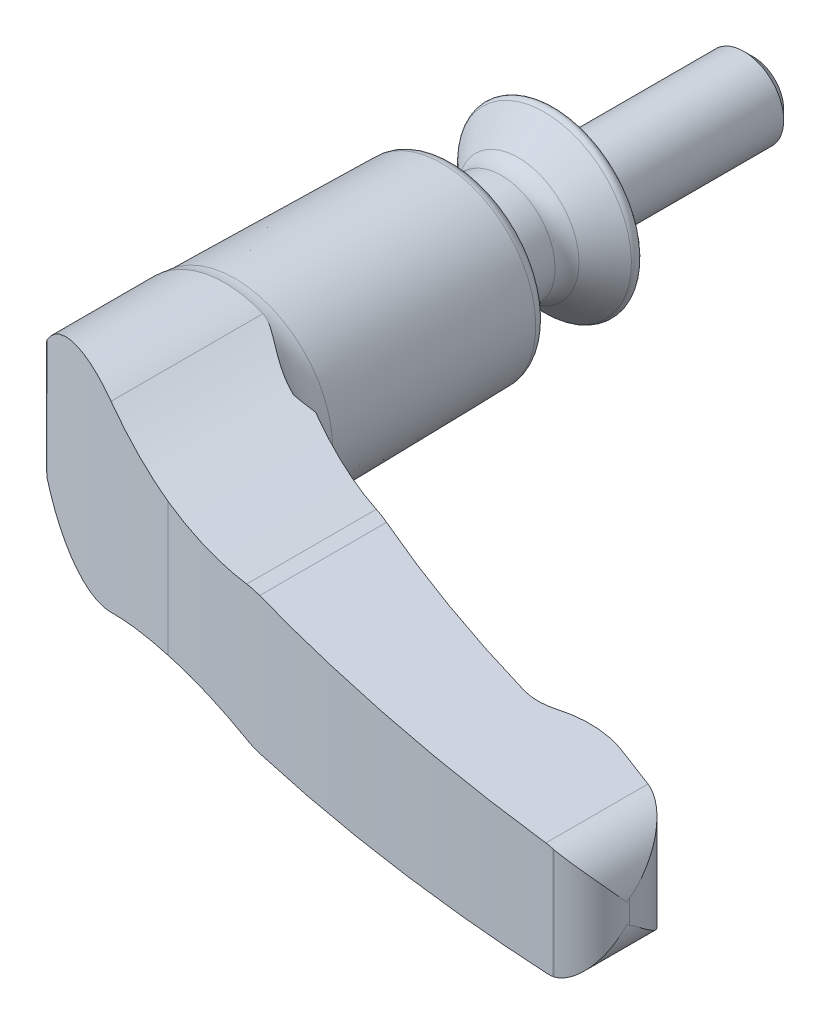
ISO-10303-21;
HEADER;
FILE_DESCRIPTION(('STEP AP214'),'2;1');
FILE_NAME('part.step','',(''),(''),'','','');
FILE_SCHEMA(('AUTOMOTIVE_DESIGN { 1 0 10303 214 1 1 1 1 }'));
ENDSEC;
DATA;
#1=APPLICATION_CONTEXT('core data for automotive mechanical design processes');
#2=APPLICATION_PROTOCOL_DEFINITION('international standard','automotive_design',2000,#1);
#3=PRODUCT_CONTEXT('',#1,'mechanical');
#4=PRODUCT('Part','Part','',(#3));
#5=PRODUCT_RELATED_PRODUCT_CATEGORY('part','',(#4));
#6=PRODUCT_DEFINITION_FORMATION('','',#4);
#7=PRODUCT_DEFINITION_CONTEXT('part definition',#1,'design');
#8=PRODUCT_DEFINITION('design','',#6,#7);
#9=PRODUCT_DEFINITION_SHAPE('','',#8);
#10=(LENGTH_UNIT() NAMED_UNIT(*) SI_UNIT(.MILLI.,.METRE.));
#11=(NAMED_UNIT(*) PLANE_ANGLE_UNIT() SI_UNIT($,.RADIAN.));
#12=(NAMED_UNIT(*) SI_UNIT($,.STERADIAN.) SOLID_ANGLE_UNIT());
#13=UNCERTAINTY_MEASURE_WITH_UNIT(LENGTH_MEASURE(1.E-05),#10,'distance_accuracy_value','');
#14=(GEOMETRIC_REPRESENTATION_CONTEXT(3) GLOBAL_UNCERTAINTY_ASSIGNED_CONTEXT((#13)) GLOBAL_UNIT_ASSIGNED_CONTEXT((#10,
#11,#12)) REPRESENTATION_CONTEXT('',''));
#15=CARTESIAN_POINT('',(0.,0.,0.));
#16=DIRECTION('',(0.,0.,1.));
#17=DIRECTION('',(1.,0.,0.));
#18=AXIS2_PLACEMENT_3D('',#15,#16,#17);
#19=CARTESIAN_POINT('',(-12.2494442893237,-13.45,40.2250875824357));
#20=DIRECTION('',(0.,0.,1.));
#21=DIRECTION('',(-1.,0.,0.));
#22=AXIS2_PLACEMENT_3D('',#19,#20,#21);
#23=PLANE('',#22);
#24=DIRECTION('',(0.,1.,0.));
#25=VECTOR('',#24,1.);
#26=CARTESIAN_POINT('',(-12.2494442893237,-13.45,40.2250875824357));
#27=LINE('',#26,#25);
#28=CARTESIAN_POINT('',(-12.2494442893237,-1.12726551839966,40.2250875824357));
#29=VERTEX_POINT('',#28);
#30=CARTESIAN_POINT('',(-12.2494442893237,0.,40.2250875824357));
#31=VERTEX_POINT('',#30);
#32=EDGE_CURVE('E175',#29,#31,#27,.T.);
#33=ORIENTED_EDGE('',*,*,#32,.T.);
#34=CARTESIAN_POINT('',(-1.62642046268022E-13,0.,40.2250875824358));
#35=DIRECTION('',(0.,0.,1.));
#36=DIRECTION('',(-1.,0.,0.));
#37=AXIS2_PLACEMENT_3D('',#34,#35,#36);
#38=CIRCLE('',#37,12.2494442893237);
#39=EDGE_CURVE('E178',#31,#31,#38,.F.);
#40=ORIENTED_EDGE('',*,*,#39,.F.);
#41=CARTESIAN_POINT('',(-12.2494442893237,1.12726551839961,40.2250875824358));
#42=VERTEX_POINT('',#41);
#43=EDGE_CURVE('E185',#31,#42,#27,.T.);
#44=ORIENTED_EDGE('',*,*,#43,.T.);
#45=CARTESIAN_POINT('',(0.,0.,40.2250875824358));
#46=DIRECTION('',(0.,0.,-1.));
#47=DIRECTION('',(1.,0.,0.));
#48=AXIS2_PLACEMENT_3D('',#45,#46,#47);
#49=CIRCLE('',#48,12.3012037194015);
#50=EDGE_CURVE('E180',#42,#29,#49,.T.);
#51=ORIENTED_EDGE('',*,*,#50,.T.);
#52=EDGE_LOOP('',(#33,#40,#44,#51));
#53=FACE_BOUND('',#52,.T.);
#54=ADVANCED_FACE('F14',(#53),#23,.F.);
#55=CARTESIAN_POINT('',(-12.3990914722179,-13.45,48.8947231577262));
#56=DIRECTION('',(0.999851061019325,0.,0.0172584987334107));
#57=DIRECTION('',(-0.0172584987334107,0.,0.999851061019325));
#58=AXIS2_PLACEMENT_3D('',#55,#56,#57);
#59=PLANE('',#58);
#60=ORIENTED_EDGE('',*,*,#43,.F.);
#61=ORIENTED_EDGE('',*,*,#32,.F.);
#62=CARTESIAN_POINT('',(-12.2494408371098,-1.12726105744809,40.2248875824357));
#63=CARTESIAN_POINT('',(-12.2501546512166,-1.12801102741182,40.2662415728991));
#64=CARTESIAN_POINT('',(-12.2508608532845,-1.13338949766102,40.3071545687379));
#65=CARTESIAN_POINT('',(-12.2522296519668,-1.15131266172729,40.3864543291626));
#66=CARTESIAN_POINT('',(-12.2528928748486,-1.16369170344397,40.4248773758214));
#67=CARTESIAN_POINT('',(-12.254538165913,-1.20206398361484,40.520195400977));
#68=CARTESIAN_POINT('',(-12.255493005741,-1.23180007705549,40.575512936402));
#69=CARTESIAN_POINT('',(-12.257344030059,-1.29909643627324,40.6827498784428));
#70=CARTESIAN_POINT('',(-12.2582382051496,-1.33683049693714,40.7345528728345));
#71=CARTESIAN_POINT('',(-12.2604895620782,-1.44052319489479,40.8649826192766));
#72=CARTESIAN_POINT('',(-12.2618006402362,-1.50977612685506,40.9409384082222));
#73=CARTESIAN_POINT('',(-12.264338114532,-1.65349391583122,41.0879440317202));
#74=CARTESIAN_POINT('',(-12.2655642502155,-1.72797350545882,41.1589787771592));
#75=CARTESIAN_POINT('',(-12.2678450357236,-1.87254522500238,41.2911134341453));
#76=CARTESIAN_POINT('',(-12.268904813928,-1.94236687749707,41.3525104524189));
#77=CARTESIAN_POINT('',(-12.2709847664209,-2.08326818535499,41.4730100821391));
#78=CARTESIAN_POINT('',(-12.2720051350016,-2.15433817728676,41.5321239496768));
#79=CARTESIAN_POINT('',(-12.2730148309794,-2.22587171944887,41.5906195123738));
#80=B_SPLINE_CURVE_WITH_KNOTS('',3,(#62,#63,#64,#65,#66,#67,#68,#69,#70,#71,#72,#73,#74,#75,#76,
#77,#78,#79),.UNSPECIFIED.,.F.,.F.,(4,2,2,2,2,2,2,2,4),(0.,0.123330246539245,0.243857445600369,
0.431247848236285,0.623227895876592,0.931023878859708,1.23972530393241,1.51862793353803,
1.79591047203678),.UNSPECIFIED.);
#81=CARTESIAN_POINT('',(-12.271249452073,-2.10212675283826,41.4883443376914));
#82=VERTEX_POINT('',#81);
#83=EDGE_CURVE('E399',#29,#82,#80,.T.);
#84=ORIENTED_EDGE('',*,*,#83,.T.);
#85=CARTESIAN_POINT('',(0.,0.,-669.432227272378));
#86=DIRECTION('',(0.999851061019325,0.,0.0172584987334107));
#87=DIRECTION('',(0.0172584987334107,0.,-0.999851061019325));
#88=AXIS2_PLACEMENT_3D('',#85,#86,#87);
#89=ELLIPSE('',#88,721.383718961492,12.45);
#90=CARTESIAN_POINT('',(-12.3990914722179,-1.12473581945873,48.8947231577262));
#91=VERTEX_POINT('',#90);
#92=EDGE_CURVE('E239',#82,#91,#89,.F.);
#93=ORIENTED_EDGE('',*,*,#92,.T.);
#94=DIRECTION('',(0.,1.,0.));
#95=VECTOR('',#94,1.);
#96=CARTESIAN_POINT('',(-12.3990914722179,-13.45,48.8947231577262));
#97=LINE('',#96,#95);
#98=CARTESIAN_POINT('',(-12.3990914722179,1.12473581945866,48.8947231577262));
#99=VERTEX_POINT('',#98);
#100=EDGE_CURVE('E184',#91,#99,#97,.T.);
#101=ORIENTED_EDGE('',*,*,#100,.T.);
#102=CARTESIAN_POINT('',(0.,0.,-669.432227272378));
#103=DIRECTION('',(0.999851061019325,0.,0.0172584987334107));
#104=DIRECTION('',(0.0172584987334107,0.,-0.999851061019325));
#105=AXIS2_PLACEMENT_3D('',#102,#103,#104);
#106=ELLIPSE('',#105,721.383718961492,12.45);
#107=CARTESIAN_POINT('',(-12.271249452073,2.10212675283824,41.4883443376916));
#108=VERTEX_POINT('',#107);
#109=EDGE_CURVE('E263',#99,#108,#106,.F.);
#110=ORIENTED_EDGE('',*,*,#109,.T.);
#111=CARTESIAN_POINT('',(-12.2730148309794,2.2258717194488,41.5906195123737));
#112=CARTESIAN_POINT('',(-12.2723484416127,2.17857656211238,41.5520130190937));
#113=CARTESIAN_POINT('',(-12.2716768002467,2.13153645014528,41.5131022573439));
#114=CARTESIAN_POINT('',(-12.2703199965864,2.03804940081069,41.4344974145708));
#115=CARTESIAN_POINT('',(-12.269634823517,1.99160298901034,41.3948027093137));
#116=CARTESIAN_POINT('',(-12.2675030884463,1.84986894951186,41.2713031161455));
#117=CARTESIAN_POINT('',(-12.2660309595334,1.75583214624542,41.1860170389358));
#118=CARTESIAN_POINT('',(-12.2637374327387,1.61936868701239,41.0531442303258));
#119=CARTESIAN_POINT('',(-12.2629577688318,1.574598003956,41.0079753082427));
#120=CARTESIAN_POINT('',(-12.2613598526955,1.48744881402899,40.9154018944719));
#121=CARTESIAN_POINT('',(-12.2605416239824,1.44506888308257,40.8679987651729));
#122=CARTESIAN_POINT('',(-12.2588634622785,1.36463549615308,40.7707764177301));
#123=CARTESIAN_POINT('',(-12.2580043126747,1.32652790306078,40.7210025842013));
#124=CARTESIAN_POINT('',(-12.2562147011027,1.25655247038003,40.6173235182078));
#125=CARTESIAN_POINT('',(-12.2552845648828,1.22465826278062,40.5634371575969));
#126=CARTESIAN_POINT('',(-12.2536883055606,1.18138793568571,40.4709597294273));
#127=CARTESIAN_POINT('',(-12.2530490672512,1.16676743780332,40.4339262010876));
#128=CARTESIAN_POINT('',(-12.2517389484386,1.14385333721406,40.3580259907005));
#129=CARTESIAN_POINT('',(-12.251068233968,1.13552979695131,40.3191689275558));
#130=CARTESIAN_POINT('',(-12.2500751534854,1.12891545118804,40.2616359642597));
#131=CARTESIAN_POINT('',(-12.2497582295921,1.12764004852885,40.2432753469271));
#132=CARTESIAN_POINT('',(-12.2494408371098,1.12726105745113,40.2248875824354));
#133=B_SPLINE_CURVE_WITH_KNOTS('',3,(#111,#112,#113,#114,#115,#116,#117,#118,#119,#120,#121,
#122,#123,#124,#125,#126,#127,#128,#129,#130,#131,#132),.UNSPECIFIED.,.F.,.F.,(4,2,2,2,2,2,2,2,
2,2,4),(0.,0.183152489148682,0.366457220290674,0.747103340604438,0.937859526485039,
1.12850085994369,1.31635856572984,1.50340080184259,1.62247471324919,1.74097889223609,
1.79613687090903),.UNSPECIFIED.);
#134=EDGE_CURVE('E190',#108,#42,#133,.T.);
#135=ORIENTED_EDGE('',*,*,#134,.T.);
#136=EDGE_LOOP('',(#60,#61,#84,#93,#101,#110,#135));
#137=FACE_BOUND('',#136,.T.);
#138=ADVANCED_FACE('F188',(#137),#59,.F.);
#139=CARTESIAN_POINT('',(111.767919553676,-13.45,-139.797819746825));
#140=DIRECTION('',(0.,1.,0.));
#141=DIRECTION('',(-1.,0.,0.));
#142=AXIS2_PLACEMENT_3D('',#139,#140,#141);
#143=CYLINDRICAL_SURFACE('',#142,208.999999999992);
#144=DIRECTION('',(0.,1.,0.));
#145=VECTOR('',#144,1.);
#146=CARTESIAN_POINT('',(15.7999999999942,-13.45,45.8662812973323));
#147=LINE('',#146,#145);
#148=CARTESIAN_POINT('',(15.8,-8.43613014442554,45.8662812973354));
#149=VERTEX_POINT('',#148);
#150=CARTESIAN_POINT('',(15.8,0.,45.8662812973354));
#151=VERTEX_POINT('',#150);
#152=EDGE_CURVE('E191',#149,#151,#147,.T.);
#153=ORIENTED_EDGE('',*,*,#152,.T.);
#154=DIRECTION('',(0.,1.,0.));
#155=VECTOR('',#154,1.);
#156=CARTESIAN_POINT('',(15.8,-13.45,45.8662812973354));
#157=LINE('',#156,#155);
#158=CARTESIAN_POINT('',(15.7999999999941,8.43613014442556,45.8662812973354));
#159=VERTEX_POINT('',#158);
#160=EDGE_CURVE('E413',#159,#151,#157,.F.);
#161=ORIENTED_EDGE('',*,*,#160,.F.);
#162=CARTESIAN_POINT('',(15.7999999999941,8.43613014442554,45.8662812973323));
#163=CARTESIAN_POINT('',(16.3870365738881,8.34717375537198,46.1697176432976));
#164=CARTESIAN_POINT('',(16.9767713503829,8.26904045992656,46.4710139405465));
#165=CARTESIAN_POINT('',(18.161091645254,8.13475115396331,47.0689822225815));
#166=CARTESIAN_POINT('',(18.7556773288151,8.07859589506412,47.3656540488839));
#167=CARTESIAN_POINT('',(20.5395968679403,7.94407204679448,48.2451118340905));
#168=CARTESIAN_POINT('',(21.7352391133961,7.89871013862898,48.8205177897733));
#169=CARTESIAN_POINT('',(24.1374209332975,7.89893976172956,49.9484747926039));
#170=CARTESIAN_POINT('',(25.3439611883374,7.94453701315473,50.5010244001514));
#171=CARTESIAN_POINT('',(27.1599173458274,8.0830634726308,51.3119106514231));
#172=CARTESIAN_POINT('',(27.7678474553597,8.14117035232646,51.5798888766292));
#173=CARTESIAN_POINT('',(28.9839481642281,8.28117670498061,52.1090693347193));
#174=CARTESIAN_POINT('',(29.5921187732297,8.36307725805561,52.370271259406));
#175=CARTESIAN_POINT('',(30.2000000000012,8.45699782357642,52.6279438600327));
#176=B_SPLINE_CURVE_WITH_KNOTS('',3,(#162,#163,#164,#165,#166,#167,#168,#169,#170,#171,#172,
#173,#174,#175),.UNSPECIFIED.,.F.,.F.,(4,2,2,2,2,2,4),(0.,2.00016069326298,4.00038978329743,
7.97994863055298,11.9597577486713,13.9600808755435,15.9604948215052),.UNSPECIFIED.);
#177=CARTESIAN_POINT('',(30.2000000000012,8.45699782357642,52.6279438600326));
#178=VERTEX_POINT('',#177);
#179=EDGE_CURVE('E264',#159,#178,#176,.T.);
#180=ORIENTED_EDGE('',*,*,#179,.T.);
#181=CARTESIAN_POINT('',(32.4002231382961,8.59297245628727,53.5458348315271));
#182=CARTESIAN_POINT('',(32.2157966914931,8.59945246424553,53.4701291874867));
#183=CARTESIAN_POINT('',(32.0313583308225,8.60144694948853,53.3941076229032));
#184=CARTESIAN_POINT('',(31.6631700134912,8.59650662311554,53.2417318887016));
#185=CARTESIAN_POINT('',(31.4794194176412,8.58958963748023,53.1653786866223));
#186=CARTESIAN_POINT('',(30.9288846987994,8.55552869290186,52.9356990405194));
#187=CARTESIAN_POINT('',(30.5630943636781,8.51506518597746,52.7818661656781));
#188=CARTESIAN_POINT('',(30.2000000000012,8.45699782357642,52.6279438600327));
#189=B_SPLINE_CURVE_WITH_KNOTS('',3,(#181,#182,#183,#184,#185,#186,#187,#188),.UNSPECIFIED.,.F.,
.F.,(4,2,2,4),(0.,0.598316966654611,1.19543895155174,2.3905773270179),.UNSPECIFIED.);
#190=CARTESIAN_POINT('',(32.4002231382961,8.59297245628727,53.5458348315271));
#191=VERTEX_POINT('',#190);
#192=EDGE_CURVE('E342',#191,#178,#189,.T.);
#193=ORIENTED_EDGE('',*,*,#192,.F.);
#194=CARTESIAN_POINT('',(111.767919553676,5.80486876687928,-139.797819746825));
#195=DIRECTION('',(-0.0351072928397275,-0.999383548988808,0.));
#196=DIRECTION('',(-0.999383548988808,0.0351072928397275,0.));
#197=AXIS2_PLACEMENT_3D('',#194,#195,#196);
#198=ELLIPSE('',#197,209.128917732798,208.999999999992);
#199=CARTESIAN_POINT('',(58.4999999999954,7.67611474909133,62.2999999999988));
#200=VERTEX_POINT('',#199);
#201=EDGE_CURVE('E350',#200,#191,#198,.T.);
#202=ORIENTED_EDGE('',*,*,#201,.F.);
#203=DIRECTION('',(0.,1.,0.));
#204=VECTOR('',#203,1.);
#205=CARTESIAN_POINT('',(58.4999999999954,-13.45,62.2999999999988));
#206=LINE('',#205,#204);
#207=CARTESIAN_POINT('',(58.4999999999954,-7.67611474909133,62.2999999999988));
#208=VERTEX_POINT('',#207);
#209=EDGE_CURVE('E193',#208,#200,#206,.T.);
#210=ORIENTED_EDGE('',*,*,#209,.F.);
#211=CARTESIAN_POINT('',(111.767919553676,-5.80486876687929,-139.797819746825));
#212=DIRECTION('',(-0.0351072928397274,0.999383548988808,0.));
#213=DIRECTION('',(0.999383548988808,0.0351072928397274,0.));
#214=AXIS2_PLACEMENT_3D('',#211,#212,#213);
#215=ELLIPSE('',#214,209.128917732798,208.999999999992);
#216=CARTESIAN_POINT('',(32.4002231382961,-8.59297245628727,53.5458348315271));
#217=VERTEX_POINT('',#216);
#218=EDGE_CURVE('E817',#217,#208,#215,.T.);
#219=ORIENTED_EDGE('',*,*,#218,.F.);
#220=CARTESIAN_POINT('',(30.2000000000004,-8.45699782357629,52.6279438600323));
#221=CARTESIAN_POINT('',(30.5630943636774,-8.51506518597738,52.7818661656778));
#222=CARTESIAN_POINT('',(30.9288846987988,-8.55552869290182,52.9356990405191));
#223=CARTESIAN_POINT('',(31.4794194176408,-8.58958963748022,53.1653786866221));
#224=CARTESIAN_POINT('',(31.6631700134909,-8.59650662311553,53.2417318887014));
#225=CARTESIAN_POINT('',(32.0313583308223,-8.60144694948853,53.3941076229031));
#226=CARTESIAN_POINT('',(32.215796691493,-8.59945246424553,53.4701291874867));
#227=CARTESIAN_POINT('',(32.4002231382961,-8.59297245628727,53.5458348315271));
#228=B_SPLINE_CURVE_WITH_KNOTS('',3,(#220,#221,#222,#223,#224,#225,#226,#227),.UNSPECIFIED.,.F.,
.F.,(4,2,2,4),(0.,1.19513837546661,1.79226036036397,2.39057732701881),.UNSPECIFIED.);
#229=CARTESIAN_POINT('',(30.2000000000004,-8.45699782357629,52.6279438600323));
#230=VERTEX_POINT('',#229);
#231=EDGE_CURVE('E317',#230,#217,#228,.T.);
#232=ORIENTED_EDGE('',*,*,#231,.F.);
#233=CARTESIAN_POINT('',(30.2,-8.45699782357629,52.6279438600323));
#234=CARTESIAN_POINT('',(29.5921187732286,-8.36307725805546,52.3702712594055));
#235=CARTESIAN_POINT('',(28.983948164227,-8.28117670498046,52.1090693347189));
#236=CARTESIAN_POINT('',(27.7678474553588,-8.14117035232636,51.5798888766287));
#237=CARTESIAN_POINT('',(27.1599173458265,-8.08306347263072,51.3119106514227));
#238=CARTESIAN_POINT('',(25.3439611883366,-7.94453701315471,50.5010244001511));
#239=CARTESIAN_POINT('',(24.1374209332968,-7.89893976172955,49.9484747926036));
#240=CARTESIAN_POINT('',(21.7352391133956,-7.89871013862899,48.820517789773));
#241=CARTESIAN_POINT('',(20.5395968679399,-7.9440720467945,48.2451118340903));
#242=CARTESIAN_POINT('',(18.7556773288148,-8.07859589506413,47.3656540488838));
#243=CARTESIAN_POINT('',(18.1610916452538,-8.13475115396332,47.0689822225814));
#244=CARTESIAN_POINT('',(16.9767713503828,-8.26904045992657,46.4710139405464));
#245=CARTESIAN_POINT('',(16.387036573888,-8.34717375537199,46.1697176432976));
#246=CARTESIAN_POINT('',(15.7999999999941,-8.43613014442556,45.8662812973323));
#247=B_SPLINE_CURVE_WITH_KNOTS('',3,(#233,#234,#235,#236,#237,#238,#239,#240,#241,#242,#243,
#244,#245,#246),.UNSPECIFIED.,.F.,.F.,(4,2,2,2,2,2,4),(0.,2.00041394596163,4.00073707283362,
7.98054619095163,11.9601050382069,13.9603341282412,15.960494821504),.UNSPECIFIED.);
#248=EDGE_CURVE('E335',#230,#149,#247,.T.);
#249=ORIENTED_EDGE('',*,*,#248,.T.);
#250=EDGE_LOOP('',(#153,#161,#180,#193,#202,#210,#219,#232,#249));
#251=FACE_BOUND('',#250,.T.);
#252=ADVANCED_FACE('F325',(#251),#143,.F.);
#253=CARTESIAN_POINT('',(76.9,-13.45,77.));
#254=DIRECTION('',(0.,0.,-1.));
#255=DIRECTION('',(0.,1.,0.));
#256=AXIS2_PLACEMENT_3D('',#253,#254,#255);
#257=PLANE('',#256);
#258=DIRECTION('',(0.,1.,0.));
#259=VECTOR('',#258,1.);
#260=CARTESIAN_POINT('',(76.9,-13.45,77.));
#261=LINE('',#260,#259);
#262=CARTESIAN_POINT('',(76.9,-6.92676825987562,77.));
#263=VERTEX_POINT('',#262);
#264=CARTESIAN_POINT('',(76.9,6.92676825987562,77.));
#265=VERTEX_POINT('',#264);
#266=EDGE_CURVE('E790',#263,#265,#261,.T.);
#267=ORIENTED_EDGE('',*,*,#266,.T.);
#268=CARTESIAN_POINT('',(75.6,1.17177043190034,77.));
#269=DIRECTION('',(0.,0.,-1.));
#270=DIRECTION('',(0.,1.,0.));
#271=AXIS2_PLACEMENT_3D('',#268,#269,#270);
#272=CIRCLE('',#271,5.9);
#273=CARTESIAN_POINT('',(76.8,6.94844767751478,77.));
#274=VERTEX_POINT('',#273);
#275=EDGE_CURVE('E860',#265,#274,#272,.F.);
#276=ORIENTED_EDGE('',*,*,#275,.T.);
#277=DIRECTION('',(0.,1.,0.));
#278=VECTOR('',#277,1.);
#279=CARTESIAN_POINT('',(76.8,-13.45,77.));
#280=LINE('',#279,#278);
#281=CARTESIAN_POINT('',(76.8,-6.94844767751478,77.));
#282=VERTEX_POINT('',#281);
#283=EDGE_CURVE('E788',#282,#274,#280,.T.);
#284=ORIENTED_EDGE('',*,*,#283,.F.);
#285=CARTESIAN_POINT('',(75.6,-1.17177043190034,77.));
#286=DIRECTION('',(0.,0.,-1.));
#287=DIRECTION('',(0.,1.,0.));
#288=AXIS2_PLACEMENT_3D('',#285,#286,#287);
#289=CIRCLE('',#288,5.9);
#290=EDGE_CURVE('E903',#282,#263,#289,.F.);
#291=ORIENTED_EDGE('',*,*,#290,.T.);
#292=EDGE_LOOP('',(#267,#276,#284,#291));
#293=FACE_BOUND('',#292,.T.);
#294=ADVANCED_FACE('F329',(#293),#257,.F.);
#295=CARTESIAN_POINT('',(99.3774025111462,-13.45,-191.753327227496));
#296=DIRECTION('',(0.,1.,0.));
#297=DIRECTION('',(-1.,0.,0.));
#298=AXIS2_PLACEMENT_3D('',#295,#296,#297);
#299=CYLINDRICAL_SURFACE('',#298,269.7);
#300=CARTESIAN_POINT('',(16.1999999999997,8.37725139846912,64.8));
#301=CARTESIAN_POINT('',(16.7767031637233,8.29486390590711,64.9869756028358));
#302=CARTESIAN_POINT('',(17.3553557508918,8.22300064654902,65.1724296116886));
#303=CARTESIAN_POINT('',(18.5159500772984,8.10050516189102,65.5400576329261));
#304=CARTESIAN_POINT('',(19.0978918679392,8.04987326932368,65.7222315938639));
#305=CARTESIAN_POINT('',(20.8414876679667,7.93052773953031,66.2615450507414));
#306=CARTESIAN_POINT('',(22.0070770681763,7.89348273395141,66.6134754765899));
#307=CARTESIAN_POINT('',(24.3425845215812,7.90540743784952,67.3013928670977));
#308=CARTESIAN_POINT('',(25.512502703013,7.95437971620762,67.6373793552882));
#309=CARTESIAN_POINT('',(27.2687809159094,8.09314767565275,68.1289718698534));
#310=CARTESIAN_POINT('',(27.8560018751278,8.15052863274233,68.2911856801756));
#311=CARTESIAN_POINT('',(29.0291528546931,8.28726693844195,68.611001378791));
#312=CARTESIAN_POINT('',(29.6150828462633,8.36662477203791,68.7686031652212));
#313=CARTESIAN_POINT('',(30.2000000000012,8.45699782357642,68.9238236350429));
#314=B_SPLINE_CURVE_WITH_KNOTS('',3,(#300,#301,#302,#303,#304,#305,#306,#307,#308,#309,#310,
#311,#312,#313),.UNSPECIFIED.,.F.,.F.,(4,2,2,2,2,2,4),(0.,1.83529834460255,3.6706254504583,
7.32170279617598,10.9728891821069,12.808257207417,14.6436657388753),.UNSPECIFIED.);
#315=CARTESIAN_POINT('',(16.1999999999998,8.37725139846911,64.8));
#316=VERTEX_POINT('',#315);
#317=CARTESIAN_POINT('',(30.2000000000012,8.45699782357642,68.9238236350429));
#318=VERTEX_POINT('',#317);
#319=EDGE_CURVE('E775',#316,#318,#314,.T.);
#320=ORIENTED_EDGE('',*,*,#319,.F.);
#321=DIRECTION('',(0.,1.,0.));
#322=VECTOR('',#321,1.);
#323=CARTESIAN_POINT('',(16.1999999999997,-13.45,64.8));
#324=LINE('',#323,#322);
#325=CARTESIAN_POINT('',(16.1999999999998,-8.37725139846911,64.8));
#326=VERTEX_POINT('',#325);
#327=EDGE_CURVE('E349',#326,#316,#324,.T.);
#328=ORIENTED_EDGE('',*,*,#327,.F.);
#329=CARTESIAN_POINT('',(30.2,-8.45699782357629,68.9238236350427));
#330=CARTESIAN_POINT('',(29.6150828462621,-8.36662477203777,68.7686031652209));
#331=CARTESIAN_POINT('',(29.029152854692,-8.28726693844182,68.6110013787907));
#332=CARTESIAN_POINT('',(27.8560018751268,-8.15052863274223,68.2911856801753));
#333=CARTESIAN_POINT('',(27.2687809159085,-8.09314767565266,68.1289718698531));
#334=CARTESIAN_POINT('',(25.5125027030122,-7.95437971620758,67.637379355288));
#335=CARTESIAN_POINT('',(24.3425845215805,-7.9054074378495,67.3013928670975));
#336=CARTESIAN_POINT('',(22.0070770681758,-7.89348273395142,66.6134754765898));
#337=CARTESIAN_POINT('',(20.8414876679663,-7.93052773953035,66.2615450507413));
#338=CARTESIAN_POINT('',(19.097891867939,-8.0498732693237,65.7222315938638));
#339=CARTESIAN_POINT('',(18.5159500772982,-8.10050516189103,65.540057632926));
#340=CARTESIAN_POINT('',(17.3553557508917,-8.22300064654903,65.1724296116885));
#341=CARTESIAN_POINT('',(16.7767031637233,-8.29486390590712,64.9869756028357));
#342=CARTESIAN_POINT('',(16.1999999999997,-8.37725139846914,64.8));
#343=B_SPLINE_CURVE_WITH_KNOTS('',3,(#329,#330,#331,#332,#333,#334,#335,#336,#337,#338,#339,
#340,#341,#342),.UNSPECIFIED.,.F.,.F.,(4,2,2,2,2,2,4),(0.,1.83540853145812,3.67077655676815,
7.32196294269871,10.9730402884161,12.8083673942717,14.6436657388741),.UNSPECIFIED.);
#344=CARTESIAN_POINT('',(30.2000000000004,-8.45699782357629,68.9238236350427));
#345=VERTEX_POINT('',#344);
#346=EDGE_CURVE('E446',#345,#326,#343,.T.);
#347=ORIENTED_EDGE('',*,*,#346,.F.);
#348=CARTESIAN_POINT('',(30.2000000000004,-8.45699782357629,68.9238236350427));
#349=CARTESIAN_POINT('',(30.5632894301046,-8.51510955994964,69.0202386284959));
#350=CARTESIAN_POINT('',(30.9292671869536,-8.55556829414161,69.1165394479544));
#351=CARTESIAN_POINT('',(31.4798508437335,-8.58960835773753,69.2601745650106));
#352=CARTESIAN_POINT('',(31.6635722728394,-8.5965163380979,69.3078974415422));
#353=CARTESIAN_POINT('',(32.0316308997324,-8.60144626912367,69.4030885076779));
#354=CARTESIAN_POINT('',(32.21596856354,-8.59944866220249,69.4505559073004));
#355=CARTESIAN_POINT('',(32.4002231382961,-8.59297245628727,69.4977922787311));
#356=B_SPLINE_CURVE_WITH_KNOTS('',3,(#348,#349,#350,#351,#352,#353,#354,#355),.UNSPECIFIED.,.F.,
.F.,(4,2,2,4),(0.,1.14021168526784,1.70984874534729,2.2807374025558),.UNSPECIFIED.);
#357=CARTESIAN_POINT('',(32.4002231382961,-8.59297245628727,69.497792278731));
#358=VERTEX_POINT('',#357);
#359=EDGE_CURVE('E292',#345,#358,#356,.T.);
#360=ORIENTED_EDGE('',*,*,#359,.T.);
#361=CARTESIAN_POINT('',(99.3774025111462,-6.24013459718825,-191.753327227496));
#362=DIRECTION('',(-0.0351072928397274,0.999383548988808,0.));
#363=DIRECTION('',(0.999383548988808,0.0351072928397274,0.));
#364=AXIS2_PLACEMENT_3D('',#361,#362,#363);
#365=ELLIPSE('',#364,269.866359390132,269.7);
#366=CARTESIAN_POINT('',(75.8071330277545,-7.06813337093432,76.9147438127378));
#367=VERTEX_POINT('',#366);
#368=EDGE_CURVE('E304',#358,#367,#365,.T.);
#369=ORIENTED_EDGE('',*,*,#368,.T.);
#370=CARTESIAN_POINT('',(75.8071330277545,-7.06813337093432,76.9147438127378));
#371=CARTESIAN_POINT('',(75.9742663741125,-7.06223993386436,76.929403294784));
#372=CARTESIAN_POINT('',(76.1405719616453,-7.04931940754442,76.943837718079));
#373=CARTESIAN_POINT('',(76.4715276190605,-7.00942417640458,76.9722564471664));
#374=CARTESIAN_POINT('',(76.6361776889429,-6.98244947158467,76.9862407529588));
#375=CARTESIAN_POINT('',(76.8,-6.94844767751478,77.));
#376=B_SPLINE_CURVE_WITH_KNOTS('',3,(#370,#371,#372,#373,#374,#375),.UNSPECIFIED.,.F.,.F.,(4,2,
4),(0.,0.50229032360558,1.00458064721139),.UNSPECIFIED.);
#377=EDGE_CURVE('E905',#367,#282,#376,.T.);
#378=ORIENTED_EDGE('',*,*,#377,.T.);
#379=ORIENTED_EDGE('',*,*,#283,.T.);
#380=CARTESIAN_POINT('',(76.8,6.94844767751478,77.));
#381=CARTESIAN_POINT('',(76.6361776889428,6.98244947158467,76.9862407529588));
#382=CARTESIAN_POINT('',(76.4715276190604,7.00942417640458,76.9722564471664));
#383=CARTESIAN_POINT('',(76.1405719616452,7.04931940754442,76.943837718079));
#384=CARTESIAN_POINT('',(75.9742663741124,7.06223993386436,76.929403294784));
#385=CARTESIAN_POINT('',(75.8071330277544,7.06813337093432,76.9147438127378));
#386=B_SPLINE_CURVE_WITH_KNOTS('',3,(#380,#381,#382,#383,#384,#385),.UNSPECIFIED.,.F.,.F.,(4,2,
4),(0.,0.502290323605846,1.00458064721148),.UNSPECIFIED.);
#387=CARTESIAN_POINT('',(75.8071330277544,7.06813337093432,76.9147438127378));
#388=VERTEX_POINT('',#387);
#389=EDGE_CURVE('E847',#274,#388,#386,.T.);
#390=ORIENTED_EDGE('',*,*,#389,.T.);
#391=CARTESIAN_POINT('',(99.3774025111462,6.24013459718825,-191.753327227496));
#392=DIRECTION('',(-0.0351072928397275,-0.999383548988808,0.));
#393=DIRECTION('',(-0.999383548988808,0.0351072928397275,0.));
#394=AXIS2_PLACEMENT_3D('',#391,#392,#393);
#395=ELLIPSE('',#394,269.866359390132,269.7);
#396=CARTESIAN_POINT('',(32.4002231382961,8.59297245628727,69.497792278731));
#397=VERTEX_POINT('',#396);
#398=EDGE_CURVE('E372',#388,#397,#395,.T.);
#399=ORIENTED_EDGE('',*,*,#398,.T.);
#400=CARTESIAN_POINT('',(32.4002231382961,8.59297245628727,69.497792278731));
#401=CARTESIAN_POINT('',(32.2159685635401,8.59944866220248,69.4505559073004));
#402=CARTESIAN_POINT('',(32.0316308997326,8.60144626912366,69.4030885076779));
#403=CARTESIAN_POINT('',(31.6635722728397,8.5965163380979,69.3078974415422));
#404=CARTESIAN_POINT('',(31.4798508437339,8.58960835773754,69.2601745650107));
#405=CARTESIAN_POINT('',(30.9292671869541,8.55556829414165,69.1165394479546));
#406=CARTESIAN_POINT('',(30.5632894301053,8.51510955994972,69.0202386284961));
#407=CARTESIAN_POINT('',(30.2000000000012,8.45699782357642,68.9238236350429));
#408=B_SPLINE_CURVE_WITH_KNOTS('',3,(#400,#401,#402,#403,#404,#405,#406,#407),.UNSPECIFIED.,.F.,
.F.,(4,2,2,4),(0.,0.5708886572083,1.14052571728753,2.28073740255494),.UNSPECIFIED.);
#409=EDGE_CURVE('E363',#397,#318,#408,.T.);
#410=ORIENTED_EDGE('',*,*,#409,.T.);
#411=EDGE_LOOP('',(#320,#328,#347,#360,#369,#378,#379,#390,#399,#410));
#412=FACE_BOUND('',#411,.T.);
#413=ADVANCED_FACE('F306',(#412),#299,.T.);
#414=CARTESIAN_POINT('',(79.8840849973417,-13.45,-124.78991881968));
#415=DIRECTION('',(0.,1.,0.));
#416=DIRECTION('',(-1.,0.,0.));
#417=AXIS2_PLACEMENT_3D('',#414,#415,#416);
#418=CYLINDRICAL_SURFACE('',#417,200.000000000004);
#419=DIRECTION('',(0.,1.,0.));
#420=VECTOR('',#419,1.);
#421=CARTESIAN_POINT('',(-9.90000000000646,-13.45,53.9244289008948));
#422=LINE('',#421,#420);
#423=CARTESIAN_POINT('',(-9.90000000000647,-7.54933771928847,53.9244289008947));
#424=VERTEX_POINT('',#423);
#425=CARTESIAN_POINT('',(-9.90000000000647,7.54933771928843,53.9244289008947));
#426=VERTEX_POINT('',#425);
#427=EDGE_CURVE('E199',#424,#426,#422,.T.);
#428=ORIENTED_EDGE('',*,*,#427,.F.);
#429=CARTESIAN_POINT('',(-9.90000000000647,-7.54933771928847,53.9244289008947));
#430=CARTESIAN_POINT('',(-9.67451817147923,-7.84507120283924,54.0377127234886));
#431=CARTESIAN_POINT('',(-9.4368447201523,-8.12923310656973,54.1565790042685));
#432=CARTESIAN_POINT('',(-8.93966759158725,-8.67296304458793,54.403880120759));
#433=CARTESIAN_POINT('',(-8.68017587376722,-8.93254438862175,54.5323097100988));
#434=CARTESIAN_POINT('',(-8.14219185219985,-9.42550410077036,54.7970082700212));
#435=CARTESIAN_POINT('',(-7.86373776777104,-9.65893280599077,54.9332613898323));
#436=CARTESIAN_POINT('',(-7.28965149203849,-10.0992248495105,55.2124187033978));
#437=CARTESIAN_POINT('',(-6.994017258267,-10.3060850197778,55.3553236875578));
#438=CARTESIAN_POINT('',(-6.38843577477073,-10.6920089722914,55.6461218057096));
#439=CARTESIAN_POINT('',(-6.07851806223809,-10.8711270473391,55.7940044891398));
#440=CARTESIAN_POINT('',(-5.44596700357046,-11.2013953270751,56.0937585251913));
#441=CARTESIAN_POINT('',(-5.12333306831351,-11.3525442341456,56.2456300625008));
#442=CARTESIAN_POINT('',(-4.46756903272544,-11.6262415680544,56.5521043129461));
#443=CARTESIAN_POINT('',(-4.13444284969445,-11.7488005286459,56.7067059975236));
#444=CARTESIAN_POINT('',(-3.45976822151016,-11.9648655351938,57.0175072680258));
#445=CARTESIAN_POINT('',(-3.11822142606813,-12.0583772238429,57.1737065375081));
#446=CARTESIAN_POINT('',(-2.31903314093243,-12.2409805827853,57.5364253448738));
#447=CARTESIAN_POINT('',(-1.85895294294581,-12.3192478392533,57.743179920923));
#448=CARTESIAN_POINT('',(-1.16440659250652,-12.3976193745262,58.0521070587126));
#449=CARTESIAN_POINT('',(-0.932215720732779,-12.4172382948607,58.1548548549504));
#450=CARTESIAN_POINT('',(-0.466758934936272,-12.443430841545,58.3597645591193));
#451=CARTESIAN_POINT('',(-0.233492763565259,-12.4500011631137,58.4619263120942));
#452=CARTESIAN_POINT('',(0.405450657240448,-12.4499979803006,58.7403022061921));
#453=CARTESIAN_POINT('',(0.811584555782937,-12.4301810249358,58.9156432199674));
#454=CARTESIAN_POINT('',(1.62179032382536,-12.3506318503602,59.2622685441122));
#455=CARTESIAN_POINT('',(2.02586144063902,-12.2908859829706,59.4335514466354));
#456=CARTESIAN_POINT('',(2.83079805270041,-12.1308842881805,59.7716755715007));
#457=CARTESIAN_POINT('',(3.23162970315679,-12.030387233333,59.9384839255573));
#458=CARTESIAN_POINT('',(4.02384464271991,-11.7891025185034,60.2652335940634));
#459=CARTESIAN_POINT('',(4.41522782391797,-11.6483143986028,60.4251748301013));
#460=CARTESIAN_POINT('',(4.79999999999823,-11.4874931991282,60.5810071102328));
#461=B_SPLINE_CURVE_WITH_KNOTS('',3,(#429,#430,#431,#432,#433,#434,#435,#436,#437,#438,#439,
#440,#441,#442,#443,#444,#445,#446,#447,#448,#449,#450,#451,#452,#453,#454,#455,#456,#457,#458,
#459,#460),.UNSPECIFIED.,.F.,.F.,(4,2,2,2,2,2,2,2,2,2,2,2,2,2,2,4),(0.,1.16572536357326,
2.33081586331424,3.49362387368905,4.65657040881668,5.81721142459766,6.97790627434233,
8.1381727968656,9.29821378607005,10.8264676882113,11.5901890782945,12.3541038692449,
13.6806107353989,15.007571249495,16.3425041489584,17.67745228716),.UNSPECIFIED.);
#462=CARTESIAN_POINT('',(4.79999999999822,-11.4874931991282,60.5810071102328));
#463=VERTEX_POINT('',#462);
#464=EDGE_CURVE('E202',#424,#463,#461,.T.);
#465=ORIENTED_EDGE('',*,*,#464,.T.);
#466=CARTESIAN_POINT('',(16.1999999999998,-8.37725139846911,64.8));
#467=CARTESIAN_POINT('',(15.21368787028,-8.51813618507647,64.4687294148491));
#468=CARTESIAN_POINT('',(14.2339762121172,-8.68971619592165,64.1310391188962));
#469=CARTESIAN_POINT('',(12.2943158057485,-9.09213654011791,63.4457683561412));
#470=CARTESIAN_POINT('',(11.3343097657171,-9.32276678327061,63.0982267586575));
#471=CARTESIAN_POINT('',(9.43367460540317,-9.8421618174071,62.3938598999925));
#472=CARTESIAN_POINT('',(8.49304509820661,-10.1309254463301,62.0370348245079));
#473=CARTESIAN_POINT('',(6.63069309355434,-10.7662294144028,61.3147410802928));
#474=CARTESIAN_POINT('',(5.70904885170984,-11.1129696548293,60.9492463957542));
#475=CARTESIAN_POINT('',(4.79999999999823,-11.4874931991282,60.5810071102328));
#476=B_SPLINE_CURVE_WITH_KNOTS('',3,(#466,#467,#468,#469,#470,#471,#472,#473,#474,#475),
.UNSPECIFIED.,.F.,.F.,(4,2,2,2,4),(0.,3.14928931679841,6.2875260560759,9.42570006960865,
12.5749263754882),.UNSPECIFIED.);
#477=EDGE_CURVE('E211',#326,#463,#476,.T.);
#478=ORIENTED_EDGE('',*,*,#477,.F.);
#479=ORIENTED_EDGE('',*,*,#327,.T.);
#480=CARTESIAN_POINT('',(4.7999999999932,11.4874931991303,60.5810071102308));
#481=CARTESIAN_POINT('',(5.70904885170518,11.1129696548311,60.9492463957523));
#482=CARTESIAN_POINT('',(6.63069309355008,10.7662294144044,61.3147410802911));
#483=CARTESIAN_POINT('',(8.49304509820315,10.1309254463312,62.0370348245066));
#484=CARTESIAN_POINT('',(9.43367460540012,9.84216181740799,62.3938598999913));
#485=CARTESIAN_POINT('',(11.3343097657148,9.32276678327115,63.0982267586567));
#486=CARTESIAN_POINT('',(12.2943158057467,9.0921365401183,63.4457683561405));
#487=CARTESIAN_POINT('',(14.2339762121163,8.6897161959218,64.1310391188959));
#488=CARTESIAN_POINT('',(15.2136878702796,8.51813618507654,64.4687294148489));
#489=CARTESIAN_POINT('',(16.1999999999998,8.37725139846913,64.8));
#490=B_SPLINE_CURVE_WITH_KNOTS('',3,(#480,#481,#482,#483,#484,#485,#486,#487,#488,#489),
.UNSPECIFIED.,.F.,.F.,(4,2,2,2,4),(0.,3.14922630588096,6.28740031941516,9.42563705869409,
12.574926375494),.UNSPECIFIED.);
#491=CARTESIAN_POINT('',(4.7999999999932,11.4874931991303,60.5810071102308));
#492=VERTEX_POINT('',#491);
#493=EDGE_CURVE('E293',#492,#316,#490,.T.);
#494=ORIENTED_EDGE('',*,*,#493,.F.);
#495=CARTESIAN_POINT('',(4.79999999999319,11.4874931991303,60.5810071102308));
#496=CARTESIAN_POINT('',(4.41580947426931,11.6480694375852,60.425410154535));
#497=CARTESIAN_POINT('',(4.02503382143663,11.7886738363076,60.2657194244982));
#498=CARTESIAN_POINT('',(3.23419246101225,12.0296727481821,59.9395455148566));
#499=CARTESIAN_POINT('',(2.8341300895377,12.1300814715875,59.7730647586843));
#500=CARTESIAN_POINT('',(2.02936760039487,12.2903278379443,59.4350346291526));
#501=CARTESIAN_POINT('',(1.62468227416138,12.3502704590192,59.2634995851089));
#502=CARTESIAN_POINT('',(0.8131282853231,12.4301064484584,58.9163098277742));
#503=CARTESIAN_POINT('',(0.406259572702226,12.4499988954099,58.7406550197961));
#504=CARTESIAN_POINT('',(-0.381370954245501,12.4500010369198,58.3974981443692));
#505=CARTESIAN_POINT('',(-0.762205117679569,12.432473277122,58.230155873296));
#506=CARTESIAN_POINT('',(-1.52013839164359,12.3627058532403,57.8943010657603));
#507=CARTESIAN_POINT('',(-1.89723770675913,12.310468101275,57.7257885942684));
#508=CARTESIAN_POINT('',(-2.64540716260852,12.1716555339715,57.3887062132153));
#509=CARTESIAN_POINT('',(-3.0164722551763,12.0850533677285,57.2201363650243));
#510=CARTESIAN_POINT('',(-3.74968971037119,11.8780234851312,56.884389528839));
#511=CARTESIAN_POINT('',(-4.11184217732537,11.7575961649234,56.717212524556));
#512=CARTESIAN_POINT('',(-4.82530709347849,11.4832593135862,56.3853387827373));
#513=CARTESIAN_POINT('',(-5.17659902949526,11.329290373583,56.2206470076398));
#514=CARTESIAN_POINT('',(-5.86509267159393,10.9886630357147,55.8955080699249));
#515=CARTESIAN_POINT('',(-6.20229273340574,10.8020008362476,55.7350614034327));
#516=CARTESIAN_POINT('',(-6.85929279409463,10.3971732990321,55.4202886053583));
#517=CARTESIAN_POINT('',(-7.17912282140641,10.1790648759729,55.2659520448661));
#518=CARTESIAN_POINT('',(-7.79913838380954,9.71218172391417,54.9648338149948));
#519=CARTESIAN_POINT('',(-8.09933309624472,9.46342148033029,54.8180486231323));
#520=CARTESIAN_POINT('',(-8.6621015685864,8.9502892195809,54.5412436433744));
#521=CARTESIAN_POINT('',(-8.92582503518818,8.6874365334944,54.410747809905));
#522=CARTESIAN_POINT('',(-9.43052390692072,8.13678568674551,54.1597401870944));
#523=CARTESIAN_POINT('',(-9.67151657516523,7.8490067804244,54.03922082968));
#524=CARTESIAN_POINT('',(-9.90000000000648,7.54933771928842,53.9244289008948));
#525=B_SPLINE_CURVE_WITH_KNOTS('',3,(#495,#496,#497,#498,#499,#500,#501,#502,#503,#504,#505,
#506,#507,#508,#509,#510,#511,#512,#513,#514,#515,#516,#517,#518,#519,#520,#521,#522,#523,#524),
.UNSPECIFIED.,.F.,.F.,(4,2,2,2,2,2,2,2,2,2,2,2,2,2,4),(0.,1.33291829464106,2.66536494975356,
3.99434151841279,5.32334866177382,6.5709370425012,7.81845670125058,9.06697126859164,
10.3154712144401,11.5662007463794,12.8170758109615,14.0657146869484,15.3137657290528,
16.4958742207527,17.6770775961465),.UNSPECIFIED.);
#526=EDGE_CURVE('E286',#492,#426,#525,.T.);
#527=ORIENTED_EDGE('',*,*,#526,.T.);
#528=EDGE_LOOP('',(#428,#465,#478,#479,#494,#527));
#529=FACE_BOUND('',#528,.T.);
#530=ADVANCED_FACE('F248',(#529),#418,.T.);
#531=CARTESIAN_POINT('',(-6.3,-13.45,49.0000000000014));
#532=DIRECTION('',(0.,1.,0.));
#533=DIRECTION('',(-1.,0.,0.));
#534=AXIS2_PLACEMENT_3D('',#531,#532,#533);
#535=CYLINDRICAL_SURFACE('',#534,6.1);
#536=ORIENTED_EDGE('',*,*,#427,.T.);
#537=CARTESIAN_POINT('',(-9.90000000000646,7.54933771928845,53.9244289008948));
#538=CARTESIAN_POINT('',(-10.0046272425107,7.41212768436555,53.8479316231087));
#539=CARTESIAN_POINT('',(-10.1057058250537,7.27366477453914,53.7689319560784));
#540=CARTESIAN_POINT('',(-10.3008751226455,6.99453251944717,53.6064237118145));
#541=CARTESIAN_POINT('',(-10.3949674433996,6.8538636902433,53.5229161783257));
#542=CARTESIAN_POINT('',(-10.6668294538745,6.42916605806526,53.2664803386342));
#543=CARTESIAN_POINT('',(-10.8343792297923,6.14218866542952,53.0874940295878));
#544=CARTESIAN_POINT('',(-11.1421944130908,5.56422896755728,52.7176240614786));
#545=CARTESIAN_POINT('',(-11.2826072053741,5.27327804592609,52.5268125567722));
#546=CARTESIAN_POINT('',(-11.5382549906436,4.68755769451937,52.1345668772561));
#547=CARTESIAN_POINT('',(-11.6534929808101,4.39278872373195,51.9331339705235));
#548=CARTESIAN_POINT('',(-11.822924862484,3.90661945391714,51.5940966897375));
#549=CARTESIAN_POINT('',(-11.8842552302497,3.71572911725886,51.4592618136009));
#550=CARTESIAN_POINT('',(-11.9969703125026,3.33388552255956,51.1855148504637));
#551=CARTESIAN_POINT('',(-12.0483542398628,3.14293226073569,51.0466024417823));
#552=CARTESIAN_POINT('',(-12.1260618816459,2.82462255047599,50.8102464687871));
#553=CARTESIAN_POINT('',(-12.1550800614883,2.6969298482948,50.7141297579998));
#554=CARTESIAN_POINT('',(-12.2086854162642,2.44281059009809,50.5191072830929));
#555=CARTESIAN_POINT('',(-12.2332743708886,2.31638354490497,50.420202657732));
#556=CARTESIAN_POINT('',(-12.2704776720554,2.10831497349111,50.2522334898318));
#557=CARTESIAN_POINT('',(-12.2843345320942,2.02594231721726,50.1843484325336));
#558=CARTESIAN_POINT('',(-12.3100752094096,1.86314619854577,50.0459284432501));
#559=CARTESIAN_POINT('',(-12.3219596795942,1.78272209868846,49.9753943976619));
#560=CARTESIAN_POINT('',(-12.3424058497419,1.63475623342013,49.8387611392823));
#561=CARTESIAN_POINT('',(-12.3511943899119,1.56681696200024,49.7731262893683));
#562=CARTESIAN_POINT('',(-12.3670759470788,1.43603364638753,49.6366694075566));
#563=CARTESIAN_POINT('',(-12.3741715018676,1.37318207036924,49.5658553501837));
#564=CARTESIAN_POINT('',(-12.3830656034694,1.28954286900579,49.4555496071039));
#565=CARTESIAN_POINT('',(-12.3856658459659,1.26425474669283,49.4195939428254));
#566=CARTESIAN_POINT('',(-12.3903418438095,1.21756776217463,49.3451522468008));
#567=CARTESIAN_POINT('',(-12.3924179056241,1.19616662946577,49.3066677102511));
#568=CARTESIAN_POINT('',(-12.3955976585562,1.16270888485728,49.2340076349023));
#569=CARTESIAN_POINT('',(-12.3968091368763,1.14966347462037,49.2003044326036));
#570=CARTESIAN_POINT('',(-12.3986849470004,1.12925581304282,49.1312436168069));
#571=CARTESIAN_POINT('',(-12.3993512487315,1.12187310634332,49.0958924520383));
#572=CARTESIAN_POINT('',(-12.3999734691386,1.11497561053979,49.0327446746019));
#573=CARTESIAN_POINT('',(-12.4000585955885,1.11402993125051,49.0051039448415));
#574=CARTESIAN_POINT('',(-12.3998578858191,1.11624858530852,48.9497493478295));
#575=CARTESIAN_POINT('',(-12.399568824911,1.11944864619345,48.9220369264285));
#576=CARTESIAN_POINT('',(-12.3990914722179,1.12473581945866,48.8947231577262));
#577=B_SPLINE_CURVE_WITH_KNOTS('',3,(#537,#538,#539,#540,#541,#542,#543,#544,#545,#546,#547,
#548,#549,#550,#551,#552,#553,#554,#555,#556,#557,#558,#559,#560,#561,#562,#563,#564,#565,#566,
#567,#568,#569,#570,#571,#572,#573,#574,#575,#576),.UNSPECIFIED.,.F.,.F.,(4,2,2,2,2,2,2,2,2,2,2,
2,2,2,2,2,2,2,2,4),(0.,0.566113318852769,1.13209611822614,2.26300366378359,3.38758494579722,
4.5120322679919,5.23669041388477,5.96140588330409,6.44865012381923,6.93569814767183,
7.25857007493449,7.58133490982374,7.86586699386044,8.14996984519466,8.28191970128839,
8.41379223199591,8.52191310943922,8.6296415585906,8.71230660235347,8.79568880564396),.UNSPECIFIED.);
#578=EDGE_CURVE('E254',#426,#99,#577,.T.);
#579=ORIENTED_EDGE('',*,*,#578,.T.);
#580=ORIENTED_EDGE('',*,*,#100,.F.);
#581=CARTESIAN_POINT('',(-12.3990914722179,-1.12473581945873,48.8947231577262));
#582=CARTESIAN_POINT('',(-12.3996477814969,-1.11855680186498,48.9263072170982));
#583=CARTESIAN_POINT('',(-12.3999461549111,-1.11526130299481,48.9584257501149));
#584=CARTESIAN_POINT('',(-12.4000388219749,-1.1142553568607,49.0224040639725));
#585=CARTESIAN_POINT('',(-12.3998385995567,-1.11648414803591,49.0542628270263));
#586=CARTESIAN_POINT('',(-12.398957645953,-1.12621618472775,49.1171143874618));
#587=CARTESIAN_POINT('',(-12.3982771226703,-1.13371714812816,49.1481075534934));
#588=CARTESIAN_POINT('',(-12.3965024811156,-1.152962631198,49.2087543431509));
#589=CARTESIAN_POINT('',(-12.3954074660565,-1.16471634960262,49.2384049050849));
#590=CARTESIAN_POINT('',(-12.3915693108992,-1.2050829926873,49.325952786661));
#591=CARTESIAN_POINT('',(-12.388289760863,-1.23859794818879,49.3815173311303));
#592=CARTESIAN_POINT('',(-12.3806880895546,-1.31242861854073,49.4879527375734));
#593=CARTESIAN_POINT('',(-12.376359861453,-1.35278373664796,49.5387936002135));
#594=CARTESIAN_POINT('',(-12.3663253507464,-1.44177329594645,49.6424016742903));
#595=CARTESIAN_POINT('',(-12.3605210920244,-1.49083153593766,49.6947913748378));
#596=CARTESIAN_POINT('',(-12.3479489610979,-1.59162003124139,49.7968362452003));
#597=CARTESIAN_POINT('',(-12.3411802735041,-1.64335252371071,49.8464890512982));
#598=CARTESIAN_POINT('',(-12.3194716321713,-1.80121349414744,49.9928499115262));
#599=CARTESIAN_POINT('',(-12.3031544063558,-1.90977427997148,50.0867143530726));
#600=CARTESIAN_POINT('',(-12.2669257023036,-2.13017179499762,50.2706532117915));
#601=CARTESIAN_POINT('',(-12.2469994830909,-2.24202032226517,50.3607101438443));
#602=CARTESIAN_POINT('',(-12.2036548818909,-2.46706676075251,50.5379086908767));
#603=CARTESIAN_POINT('',(-12.1802416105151,-2.58026247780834,50.6250543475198));
#604=CARTESIAN_POINT('',(-12.1164026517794,-2.86831170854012,50.843495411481));
#605=CARTESIAN_POINT('',(-12.0735859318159,-3.04368513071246,50.9734118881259));
#606=CARTESIAN_POINT('',(-11.9795791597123,-3.39488995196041,51.2295643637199));
#607=CARTESIAN_POINT('',(-11.9283877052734,-3.57072142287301,51.3557997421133));
#608=CARTESIAN_POINT('',(-11.7619352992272,-4.09821672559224,51.7298192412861));
#609=CARTESIAN_POINT('',(-11.6338805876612,-4.44949493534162,51.9726289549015));
#610=CARTESIAN_POINT('',(-11.34324189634,-5.14539140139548,52.4426131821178));
#611=CARTESIAN_POINT('',(-11.18082918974,-5.49003376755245,52.6698581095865));
#612=CARTESIAN_POINT('',(-10.8197440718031,-6.17121731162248,53.1063377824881));
#613=CARTESIAN_POINT('',(-10.6211196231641,-6.50776854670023,53.3155958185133));
#614=CARTESIAN_POINT('',(-10.3247304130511,-6.95867015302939,53.5850738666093));
#615=CARTESIAN_POINT('',(-10.2433360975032,-7.07796998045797,53.6553033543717));
#616=CARTESIAN_POINT('',(-10.075485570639,-7.31492708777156,53.7924366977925));
#617=CARTESIAN_POINT('',(-9.98902887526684,-7.43258420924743,53.8593402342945));
#618=CARTESIAN_POINT('',(-9.90000000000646,-7.54933771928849,53.9244289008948));
#619=B_SPLINE_CURVE_WITH_KNOTS('',3,(#581,#582,#583,#584,#585,#586,#587,#588,#589,#590,#591,
#592,#593,#594,#595,#596,#597,#598,#599,#600,#601,#602,#603,#604,#605,#606,#607,#608,#609,#610,
#611,#612,#613,#614,#615,#616,#617,#618),.UNSPECIFIED.,.F.,.F.,(4,2,2,2,2,2,2,2,2,2,2,2,2,2,2,2,
2,2,4),(0.,0.0963901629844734,0.191724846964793,0.287018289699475,0.382519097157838,
0.576300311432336,0.771238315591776,0.98706846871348,1.20308219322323,1.63612237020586,
2.07097291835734,2.50519231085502,3.17221143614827,3.83934236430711,5.17506750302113,
6.50428472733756,7.83175401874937,8.31342982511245,8.79515176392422),.UNSPECIFIED.);
#620=EDGE_CURVE('E230',#91,#424,#619,.T.);
#621=ORIENTED_EDGE('',*,*,#620,.T.);
#622=EDGE_LOOP('',(#536,#579,#580,#621));
#623=FACE_BOUND('',#622,.T.);
#624=ADVANCED_FACE('F243',(#623),#535,.T.);
#625=CARTESIAN_POINT('',(60.181295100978,-13.45,55.4019389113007));
#626=DIRECTION('',(0.,1.,0.));
#627=DIRECTION('',(-1.,0.,0.));
#628=AXIS2_PLACEMENT_3D('',#625,#626,#627);
#629=CYLINDRICAL_SURFACE('',#628,7.0999999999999);
#630=CARTESIAN_POINT('',(60.181295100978,7.61705262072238,55.4019389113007));
#631=DIRECTION('',(-0.0351072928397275,-0.999383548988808,0.));
#632=DIRECTION('',(-0.999383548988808,0.0351072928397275,0.));
#633=AXIS2_PLACEMENT_3D('',#630,#631,#632);
#634=ELLIPSE('',#633,7.10437950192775,7.0999999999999);
#635=CARTESIAN_POINT('',(62.4000000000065,7.53911185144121,62.1463698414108));
#636=VERTEX_POINT('',#635);
#637=EDGE_CURVE('E813',#636,#200,#634,.T.);
#638=ORIENTED_EDGE('',*,*,#637,.F.);
#639=DIRECTION('',(0.,1.,0.));
#640=VECTOR('',#639,1.);
#641=CARTESIAN_POINT('',(62.4000000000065,-13.45,62.1463698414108));
#642=LINE('',#641,#640);
#643=CARTESIAN_POINT('',(62.4000000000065,-7.53911185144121,62.1463698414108));
#644=VERTEX_POINT('',#643);
#645=EDGE_CURVE('E806',#644,#636,#642,.T.);
#646=ORIENTED_EDGE('',*,*,#645,.F.);
#647=CARTESIAN_POINT('',(60.181295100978,-7.61705262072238,55.4019389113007));
#648=DIRECTION('',(-0.0351072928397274,0.999383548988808,0.));
#649=DIRECTION('',(0.999383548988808,0.0351072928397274,0.));
#650=AXIS2_PLACEMENT_3D('',#647,#648,#649);
#651=ELLIPSE('',#650,7.10437950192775,7.0999999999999);
#652=EDGE_CURVE('E814',#208,#644,#651,.T.);
#653=ORIENTED_EDGE('',*,*,#652,.F.);
#654=ORIENTED_EDGE('',*,*,#209,.T.);
#655=EDGE_LOOP('',(#638,#646,#653,#654));
#656=FACE_BOUND('',#655,.T.);
#657=ADVANCED_FACE('F247',(#656),#629,.F.);
#658=CARTESIAN_POINT('',(66.4,-13.45,74.2));
#659=DIRECTION('',(0.,1.,0.));
#660=DIRECTION('',(-1.,0.,0.));
#661=AXIS2_PLACEMENT_3D('',#658,#659,#660);
#662=CYLINDRICAL_SURFACE('',#661,12.7);
#663=ORIENTED_EDGE('',*,*,#645,.T.);
#664=CARTESIAN_POINT('',(66.4,7.39859605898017,74.2));
#665=DIRECTION('',(-0.0351072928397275,-0.999383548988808,0.));
#666=DIRECTION('',(-0.999383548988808,0.0351072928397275,0.));
#667=AXIS2_PLACEMENT_3D('',#664,#665,#666);
#668=ELLIPSE('',#667,12.7078337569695,12.7);
#669=CARTESIAN_POINT('',(70.7,7.24754158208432,62.2501046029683));
#670=VERTEX_POINT('',#669);
#671=EDGE_CURVE('E819',#636,#670,#668,.T.);
#672=ORIENTED_EDGE('',*,*,#671,.T.);
#673=DIRECTION('',(0.,1.,0.));
#674=VECTOR('',#673,1.);
#675=CARTESIAN_POINT('',(70.7,-13.45,62.2501046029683));
#676=LINE('',#675,#674);
#677=CARTESIAN_POINT('',(70.7,-7.24754158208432,62.2501046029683));
#678=VERTEX_POINT('',#677);
#679=EDGE_CURVE('E803',#678,#670,#676,.T.);
#680=ORIENTED_EDGE('',*,*,#679,.F.);
#681=CARTESIAN_POINT('',(66.4,-7.39859605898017,74.2));
#682=DIRECTION('',(-0.0351072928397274,0.999383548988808,0.));
#683=DIRECTION('',(0.999383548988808,0.0351072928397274,0.));
#684=AXIS2_PLACEMENT_3D('',#681,#682,#683);
#685=ELLIPSE('',#684,12.7078337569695,12.7);
#686=EDGE_CURVE('E899',#678,#644,#685,.T.);
#687=ORIENTED_EDGE('',*,*,#686,.T.);
#688=EDGE_LOOP('',(#663,#672,#680,#687));
#689=FACE_BOUND('',#688,.T.);
#690=ADVANCED_FACE('F550',(#689),#662,.T.);
#691=CARTESIAN_POINT('',(70.7,-13.45,62.2501046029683));
#692=DIRECTION('',(-0.336318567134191,0.,0.941748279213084));
#693=DIRECTION('',(-0.941748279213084,0.,-0.336318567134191));
#694=AXIS2_PLACEMENT_3D('',#691,#692,#693);
#695=PLANE('',#694);
#696=ORIENTED_EDGE('',*,*,#679,.T.);
#697=DIRECTION('',(0.94123334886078,-0.0330645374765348,0.336134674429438));
#698=VECTOR('',#697,1.);
#699=CARTESIAN_POINT('',(71.3441374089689,7.22491371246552,62.480139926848));
#700=LINE('',#699,#698);
#701=CARTESIAN_POINT('',(75.6,7.07540973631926,64.));
#702=VERTEX_POINT('',#701);
#703=EDGE_CURVE('E821',#670,#702,#700,.T.);
#704=ORIENTED_EDGE('',*,*,#703,.T.);
#705=DIRECTION('',(0.,1.,0.));
#706=VECTOR('',#705,1.);
#707=CARTESIAN_POINT('',(75.6,-13.45,64.));
#708=LINE('',#707,#706);
#709=CARTESIAN_POINT('',(75.6,-7.07540973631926,64.));
#710=VERTEX_POINT('',#709);
#711=EDGE_CURVE('E800',#710,#702,#708,.T.);
#712=ORIENTED_EDGE('',*,*,#711,.F.);
#713=DIRECTION('',(-0.94123334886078,-0.0330645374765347,-0.336134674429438));
#714=VECTOR('',#713,1.);
#715=CARTESIAN_POINT('',(70.5069705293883,-7.25432250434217,62.1811696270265));
#716=LINE('',#715,#714);
#717=EDGE_CURVE('E897',#710,#678,#716,.T.);
#718=ORIENTED_EDGE('',*,*,#717,.T.);
#719=EDGE_LOOP('',(#696,#704,#712,#718));
#720=FACE_BOUND('',#719,.T.);
#721=ADVANCED_FACE('F557',(#720),#695,.F.);
#722=CARTESIAN_POINT('',(72.7912409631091,-13.45,72.2341285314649));
#723=DIRECTION('',(0.,1.,0.));
#724=DIRECTION('',(-1.,0.,0.));
#725=AXIS2_PLACEMENT_3D('',#722,#723,#724);
#726=CYLINDRICAL_SURFACE('',#725,8.7);
#727=ORIENTED_EDGE('',*,*,#711,.T.);
#728=CARTESIAN_POINT('',(72.7912409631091,7.17407848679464,72.2341285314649));
#729=DIRECTION('',(-0.0351072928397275,-0.999383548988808,0.));
#730=DIRECTION('',(-0.999383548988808,0.0351072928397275,0.));
#731=AXIS2_PLACEMENT_3D('',#728,#729,#730);
#732=ELLIPSE('',#731,8.70536643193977,8.7);
#733=CARTESIAN_POINT('',(75.8071330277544,7.06813337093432,64.0735896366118));
#734=VERTEX_POINT('',#733);
#735=EDGE_CURVE('E826',#702,#734,#732,.T.);
#736=ORIENTED_EDGE('',*,*,#735,.T.);
#737=CARTESIAN_POINT('',(75.8071330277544,7.06813337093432,64.0735896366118));
#738=CARTESIAN_POINT('',(75.9748168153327,7.0622663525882,64.1355169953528));
#739=CARTESIAN_POINT('',(76.1402427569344,7.04927280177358,64.2025682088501));
#740=CARTESIAN_POINT('',(76.4651507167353,7.01027717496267,64.3459302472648));
#741=CARTESIAN_POINT('',(76.6246418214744,6.98429594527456,64.4222260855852));
#742=CARTESIAN_POINT('',(76.9351663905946,6.9208757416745,64.582452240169));
#743=CARTESIAN_POINT('',(77.0862707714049,6.88355922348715,64.6662945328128));
#744=CARTESIAN_POINT('',(77.3811468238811,6.79858747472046,64.8414171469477));
#745=CARTESIAN_POINT('',(77.5249148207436,6.75092712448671,64.9327011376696));
#746=CARTESIAN_POINT('',(77.8380186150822,6.63395683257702,65.1444339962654));
#747=CARTESIAN_POINT('',(78.005254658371,6.56219500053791,65.2666396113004));
#748=CARTESIAN_POINT('',(78.3271597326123,6.40670809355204,65.5195506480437));
#749=CARTESIAN_POINT('',(78.4818270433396,6.32298138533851,65.6502572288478));
#750=CARTESIAN_POINT('',(78.9282885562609,6.05574314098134,66.0544687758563));
#751=CARTESIAN_POINT('',(79.2010745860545,5.85675187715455,66.3390528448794));
#752=CARTESIAN_POINT('',(79.6212718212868,5.49510018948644,66.8385205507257));
#753=CARTESIAN_POINT('',(79.7815834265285,5.33979301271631,67.0482834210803));
#754=CARTESIAN_POINT('',(80.0792554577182,5.01810183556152,67.4757028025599));
#755=CARTESIAN_POINT('',(80.2166059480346,4.85171308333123,67.6933626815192));
#756=CARTESIAN_POINT('',(80.4688577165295,4.51080057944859,68.1342958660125));
#757=CARTESIAN_POINT('',(80.5838017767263,4.33629313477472,68.3575575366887));
#758=CARTESIAN_POINT('',(80.7924070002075,3.980921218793,68.8087688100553));
#759=CARTESIAN_POINT('',(80.8860749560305,3.80005879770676,69.0367168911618));
#760=CARTESIAN_POINT('',(81.0220373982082,3.5014917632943,69.4114104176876));
#761=CARTESIAN_POINT('',(81.0705249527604,3.38514716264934,69.5570339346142));
#762=CARTESIAN_POINT('',(81.1594897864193,3.15109866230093,69.8496372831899));
#763=CARTESIAN_POINT('',(81.1999671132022,3.03339477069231,69.996617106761));
#764=CARTESIAN_POINT('',(81.2731856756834,2.79669546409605,70.2924967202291));
#765=CARTESIAN_POINT('',(81.3058938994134,2.6776967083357,70.4414019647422));
#766=CARTESIAN_POINT('',(81.363446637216,2.43969124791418,70.7406319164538));
#767=CARTESIAN_POINT('',(81.3882943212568,2.3206845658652,70.8909560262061));
#768=CARTESIAN_POINT('',(81.4186700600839,2.1495216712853,71.1106579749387));
#769=CARTESIAN_POINT('',(81.4273037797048,2.09662683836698,71.1790441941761));
#770=CARTESIAN_POINT('',(81.4430078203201,1.99157076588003,71.3166649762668));
#771=CARTESIAN_POINT('',(81.4500767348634,1.9394102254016,71.3859002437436));
#772=CARTESIAN_POINT('',(81.4625621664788,1.83734039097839,71.5249037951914));
#773=CARTESIAN_POINT('',(81.4679969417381,1.78741197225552,71.5946565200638));
#774=CARTESIAN_POINT('',(81.4772968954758,1.69106187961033,71.7366034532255));
#775=CARTESIAN_POINT('',(81.4811648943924,1.64463402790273,71.8087930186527));
#776=CARTESIAN_POINT('',(81.4855719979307,1.58456919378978,71.9182598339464));
#777=CARTESIAN_POINT('',(81.4867768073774,1.56684439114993,71.9531394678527));
#778=CARTESIAN_POINT('',(81.4887992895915,1.53551651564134,72.024939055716));
#779=CARTESIAN_POINT('',(81.4896143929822,1.5219410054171,72.0618708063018));
#780=CARTESIAN_POINT('',(81.4902069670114,1.51156726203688,72.1));
#781=B_SPLINE_CURVE_WITH_KNOTS('',3,(#737,#738,#739,#740,#741,#742,#743,#744,#745,#746,#747,
#748,#749,#750,#751,#752,#753,#754,#755,#756,#757,#758,#759,#760,#761,#762,#763,#764,#765,#766,
#767,#768,#769,#770,#771,#772,#773,#774,#775,#776,#777,#778,#779,#780),.UNSPECIFIED.,.F.,.F.,(4,
2,2,2,2,2,2,2,2,2,2,2,2,2,2,2,2,2,2,2,2,4),(0.,0.536164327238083,1.07147081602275,
1.60118847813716,2.13116892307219,2.78779365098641,3.44450809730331,4.76349206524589,
5.68138269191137,6.59966948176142,7.51618537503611,8.4324082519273,9.01003959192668,
9.58766749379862,10.1677075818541,10.7475134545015,11.0081582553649,11.2690363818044,
11.5268810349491,11.7842594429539,11.9014682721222,12.0194395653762),.UNSPECIFIED.);
#782=CARTESIAN_POINT('',(81.4902069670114,1.511567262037,72.1));
#783=VERTEX_POINT('',#782);
#784=EDGE_CURVE('E829',#734,#783,#781,.T.);
#785=ORIENTED_EDGE('',*,*,#784,.T.);
#786=DIRECTION('',(0.,1.,0.));
#787=VECTOR('',#786,1.);
#788=CARTESIAN_POINT('',(81.4902069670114,-13.45,72.1));
#789=LINE('',#788,#787);
#790=CARTESIAN_POINT('',(81.4902069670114,-1.51156726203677,72.1));
#791=VERTEX_POINT('',#790);
#792=EDGE_CURVE('E795',#791,#783,#789,.T.);
#793=ORIENTED_EDGE('',*,*,#792,.F.);
#794=CARTESIAN_POINT('',(81.4902069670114,-1.51156726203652,72.1));
#795=CARTESIAN_POINT('',(81.4896591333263,-1.52114021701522,72.064692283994));
#796=CARTESIAN_POINT('',(81.4889190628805,-1.53350579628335,72.0304000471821));
#797=CARTESIAN_POINT('',(81.4870982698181,-1.56197652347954,71.9635934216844));
#798=CARTESIAN_POINT('',(81.4860193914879,-1.57806130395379,71.9310705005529));
#799=CARTESIAN_POINT('',(81.4823449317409,-1.62912404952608,71.8356895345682));
#800=CARTESIAN_POINT('',(81.4793026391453,-1.66709572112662,71.7745328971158));
#801=CARTESIAN_POINT('',(81.4721239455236,-1.74601190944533,71.6546083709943));
#802=CARTESIAN_POINT('',(81.4679909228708,-1.78694696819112,71.5958337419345));
#803=CARTESIAN_POINT('',(81.4586343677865,-1.87046577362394,71.4793364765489));
#804=CARTESIAN_POINT('',(81.4534081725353,-1.91305333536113,71.4216167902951));
#805=CARTESIAN_POINT('',(81.436522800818,-2.03894133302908,71.2535721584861));
#806=CARTESIAN_POINT('',(81.4233980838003,-2.12330595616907,71.1441960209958));
#807=CARTESIAN_POINT('',(81.3931392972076,-2.29292863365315,70.9267015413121));
#808=CARTESIAN_POINT('',(81.3760048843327,-2.37818676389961,70.8185833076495));
#809=CARTESIAN_POINT('',(81.3185819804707,-2.63407141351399,70.495653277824));
#810=CARTESIAN_POINT('',(81.2722550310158,-2.80495229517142,70.2820807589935));
#811=CARTESIAN_POINT('',(81.162900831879,-3.1457030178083,69.8563515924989));
#812=CARTESIAN_POINT('',(81.0997793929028,-3.31556145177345,69.6442100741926));
#813=CARTESIAN_POINT('',(80.9565365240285,-3.65187438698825,69.2229048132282));
#814=CARTESIAN_POINT('',(80.8764125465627,-3.81832837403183,69.0137415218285));
#815=CARTESIAN_POINT('',(80.6984556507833,-4.14678790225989,68.5985997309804));
#816=CARTESIAN_POINT('',(80.6005826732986,-4.30878240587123,68.3926296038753));
#817=CARTESIAN_POINT('',(80.3866334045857,-4.62645030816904,67.9852525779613));
#818=CARTESIAN_POINT('',(80.2705561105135,-4.78212335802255,67.7838459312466));
#819=CARTESIAN_POINT('',(80.0196477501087,-5.08525919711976,67.386942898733));
#820=CARTESIAN_POINT('',(79.8848345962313,-5.23272964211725,67.1914410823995));
#821=CARTESIAN_POINT('',(79.5956960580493,-5.51752354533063,66.8076115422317));
#822=CARTESIAN_POINT('',(79.4413769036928,-5.65485022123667,66.6192815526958));
#823=CARTESIAN_POINT('',(79.157783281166,-5.8808483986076,66.3020852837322));
#824=CARTESIAN_POINT('',(79.0332691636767,-5.97252495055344,66.1710921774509));
#825=CARTESIAN_POINT('',(78.7734390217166,-6.14810172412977,65.9145846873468));
#826=CARTESIAN_POINT('',(78.6381202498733,-6.23199995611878,65.7890717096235));
#827=CARTESIAN_POINT('',(78.3571714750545,-6.39038297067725,65.5449639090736));
#828=CARTESIAN_POINT('',(78.211580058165,-6.46490032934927,65.4263459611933));
#829=CARTESIAN_POINT('',(77.90986791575,-6.6033479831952,65.1966882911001));
#830=CARTESIAN_POINT('',(77.753753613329,-6.66728465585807,65.0856440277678));
#831=CARTESIAN_POINT('',(77.4573177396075,-6.77364633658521,64.8894686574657));
#832=CARTESIAN_POINT('',(77.3185002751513,-6.81787742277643,64.803043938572));
#833=CARTESIAN_POINT('',(77.0341992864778,-6.8967005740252,64.6371299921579));
#834=CARTESIAN_POINT('',(76.8887186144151,-6.93129671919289,64.5576378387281));
#835=CARTESIAN_POINT('',(76.5902920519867,-6.99007260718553,64.4056253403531));
#836=CARTESIAN_POINT('',(76.4372885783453,-7.01415075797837,64.3331780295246));
#837=CARTESIAN_POINT('',(76.125924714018,-7.05038194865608,64.196779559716));
#838=CARTESIAN_POINT('',(75.9675571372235,-7.0625182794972,64.1328404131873));
#839=CARTESIAN_POINT('',(75.8071330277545,-7.06813337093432,64.0735896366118));
#840=B_SPLINE_CURVE_WITH_KNOTS('',3,(#794,#795,#796,#797,#798,#799,#800,#801,#802,#803,#804,
#805,#806,#807,#808,#809,#810,#811,#812,#813,#814,#815,#816,#817,#818,#819,#820,#821,#822,#823,
#824,#825,#826,#827,#828,#829,#830,#831,#832,#833,#834,#835,#836,#837,#838,#839),.UNSPECIFIED.,
.F.,.F.,(4,2,2,2,2,2,2,2,2,2,2,2,2,2,2,2,2,2,2,2,2,2,4),(0.,0.109289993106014,0.21799509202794,
0.433861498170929,0.649066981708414,0.86480291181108,1.28097583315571,1.69718439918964,
2.52889594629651,3.36537410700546,4.20197768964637,5.04049351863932,5.87905555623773,
6.71682133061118,7.55432020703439,8.1618256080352,8.76948597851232,9.37497428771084,
9.98009630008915,10.4877919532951,10.9952722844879,11.5075513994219,12.0205462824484),.UNSPECIFIED.);
#841=CARTESIAN_POINT('',(75.8071330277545,-7.06813337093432,64.0735896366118));
#842=VERTEX_POINT('',#841);
#843=EDGE_CURVE('E880',#791,#842,#840,.T.);
#844=ORIENTED_EDGE('',*,*,#843,.T.);
#845=CARTESIAN_POINT('',(72.7912409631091,-7.17407848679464,72.2341285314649));
#846=DIRECTION('',(-0.0351072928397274,0.999383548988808,0.));
#847=DIRECTION('',(0.999383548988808,0.0351072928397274,0.));
#848=AXIS2_PLACEMENT_3D('',#845,#846,#847);
#849=ELLIPSE('',#848,8.70536643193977,8.7);
#850=EDGE_CURVE('E323',#842,#710,#849,.T.);
#851=ORIENTED_EDGE('',*,*,#850,.T.);
#852=EDGE_LOOP('',(#727,#736,#785,#793,#844,#851));
#853=FACE_BOUND('',#852,.T.);
#854=ADVANCED_FACE('F564',(#853),#726,.T.);
#855=CARTESIAN_POINT('',(76.9,-13.45,72.4));
#856=DIRECTION('',(0.,1.,0.));
#857=DIRECTION('',(-1.,0.,0.));
#858=AXIS2_PLACEMENT_3D('',#855,#856,#857);
#859=CYLINDRICAL_SURFACE('',#858,4.6);
#860=CARTESIAN_POINT('',(76.9,-6.92676825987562,77.));
#861=CARTESIAN_POINT('',(77.0197544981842,-6.89974760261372,77.0000242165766));
#862=CARTESIAN_POINT('',(77.1385997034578,-6.8689438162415,76.9953251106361));
#863=CARTESIAN_POINT('',(77.3733866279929,-6.80026465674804,76.9770832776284));
#864=CARTESIAN_POINT('',(77.4893317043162,-6.76239793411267,76.9635513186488));
#865=CARTESIAN_POINT('',(77.7164787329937,-6.68039891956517,76.9284065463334));
#866=CARTESIAN_POINT('',(77.8277145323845,-6.63632753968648,76.9068692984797));
#867=CARTESIAN_POINT('',(78.0458969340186,-6.54221936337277,76.8563965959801));
#868=CARTESIAN_POINT('',(78.152842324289,-6.49218089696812,76.8274590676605));
#869=CARTESIAN_POINT('',(78.4653916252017,-6.33449171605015,76.7309204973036));
#870=CARTESIAN_POINT('',(78.663990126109,-6.21879632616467,76.6533812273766));
#871=CARTESIAN_POINT('',(79.0402432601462,-5.97029934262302,76.4771027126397));
#872=CARTESIAN_POINT('',(79.2178408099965,-5.83745308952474,76.3783076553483));
#873=CARTESIAN_POINT('',(79.6424844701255,-5.48235672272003,76.105752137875));
#874=CARTESIAN_POINT('',(79.8745658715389,-5.25086841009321,75.9204968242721));
#875=CARTESIAN_POINT('',(80.1851053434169,-4.88826143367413,75.6231550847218));
#876=CARTESIAN_POINT('',(80.282474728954,-4.76462911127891,75.5206262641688));
#877=CARTESIAN_POINT('',(80.4651662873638,-4.51307003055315,75.3101518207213));
#878=CARTESIAN_POINT('',(80.5504886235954,-4.38514333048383,75.2022062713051));
#879=CARTESIAN_POINT('',(80.7387435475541,-4.0780830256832,74.9413804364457));
#880=CARTESIAN_POINT('',(80.8365843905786,-3.89744638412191,74.7865960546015));
#881=CARTESIAN_POINT('',(81.0114064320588,-3.53139598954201,74.4709642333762));
#882=CARTESIAN_POINT('',(81.0883795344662,-3.34598041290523,74.3101144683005));
#883=CARTESIAN_POINT('',(81.2221611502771,-2.97196427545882,73.984266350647));
#884=CARTESIAN_POINT('',(81.2789919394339,-2.78336747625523,73.8192727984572));
#885=CARTESIAN_POINT('',(81.3732010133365,-2.40398712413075,73.4864566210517));
#886=CARTESIAN_POINT('',(81.4105832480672,-2.21320402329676,73.3186345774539));
#887=CARTESIAN_POINT('',(81.4774753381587,-1.75368402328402,72.9137942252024));
#888=CARTESIAN_POINT('',(81.4978679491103,-1.48426548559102,72.6759267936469));
#889=CARTESIAN_POINT('',(81.4999190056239,-1.2044431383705,72.42884946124));
#890=CARTESIAN_POINT('',(81.4999681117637,-1.19386465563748,72.4195088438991));
#891=CARTESIAN_POINT('',(81.4999962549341,-1.17944753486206,72.4067787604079));
#892=CARTESIAN_POINT('',(81.5000000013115,-1.17560900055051,72.4033893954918));
#893=CARTESIAN_POINT('',(81.5,-1.17177043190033,72.4));
#894=B_SPLINE_CURVE_WITH_KNOTS('',3,(#860,#861,#862,#863,#864,#865,#866,#867,#868,#869,#870,
#871,#872,#873,#874,#875,#876,#877,#878,#879,#880,#881,#882,#883,#884,#885,#886,#887,#888,#889,
#890,#891,#892,#893),.UNSPECIFIED.,.F.,.F.,(4,2,2,2,2,2,2,2,2,2,2,2,2,2,2,2,4),(0.,
0.368063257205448,0.735678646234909,1.09990860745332,1.46424074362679,2.18881069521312,
2.91530692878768,4.03811358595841,4.60124206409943,5.16436290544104,5.93493170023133,
6.70579902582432,7.47581115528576,8.24566683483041,9.32320253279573,9.36553959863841,
9.38090189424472),.UNSPECIFIED.);
#895=CARTESIAN_POINT('',(81.5,-1.17177043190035,72.4));
#896=VERTEX_POINT('',#895);
#897=EDGE_CURVE('E866',#263,#896,#894,.T.);
#898=ORIENTED_EDGE('',*,*,#897,.T.);
#899=CARTESIAN_POINT('',(81.4902069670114,-1.51156726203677,72.1));
#900=CARTESIAN_POINT('',(81.49651449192,-1.4021609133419,72.1965810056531));
#901=CARTESIAN_POINT('',(81.4997750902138,-1.29273384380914,72.2931916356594));
#902=CARTESIAN_POINT('',(81.499996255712,-1.17944753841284,72.393221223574));
#903=CARTESIAN_POINT('',(81.5000000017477,-1.17560899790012,72.3966105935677));
#904=CARTESIAN_POINT('',(81.5,-1.17177043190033,72.4));
#905=B_SPLINE_CURVE_WITH_KNOTS('',3,(#899,#900,#901,#902,#903,#904),.UNSPECIFIED.,.F.,.F.,(4,2,
4),(0.,0.438025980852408,0.4533882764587),.UNSPECIFIED.);
#906=EDGE_CURVE('E874',#896,#791,#905,.F.);
#907=ORIENTED_EDGE('',*,*,#906,.T.);
#908=ORIENTED_EDGE('',*,*,#792,.T.);
#909=CARTESIAN_POINT('',(81.4902069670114,1.511567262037,72.1));
#910=CARTESIAN_POINT('',(81.49651449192,1.40216091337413,72.1965810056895));
#911=CARTESIAN_POINT('',(81.4997750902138,1.29273384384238,72.293191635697));
#912=CARTESIAN_POINT('',(81.499996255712,1.17944753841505,72.3932212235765));
#913=CARTESIAN_POINT('',(81.5000000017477,1.17560899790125,72.396610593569));
#914=CARTESIAN_POINT('',(81.5,1.17177043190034,72.4));
#915=B_SPLINE_CURVE_WITH_KNOTS('',3,(#909,#910,#911,#912,#913,#914),.UNSPECIFIED.,.F.,.F.,(4,2,
4),(0.,0.438025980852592,0.453388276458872),.UNSPECIFIED.);
#916=CARTESIAN_POINT('',(81.5,1.17177043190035,72.4));
#917=VERTEX_POINT('',#916);
#918=EDGE_CURVE('E836',#783,#917,#915,.T.);
#919=ORIENTED_EDGE('',*,*,#918,.T.);
#920=CARTESIAN_POINT('',(76.9,6.92676825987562,77.));
#921=CARTESIAN_POINT('',(77.0197544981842,6.89974760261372,77.0000242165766));
#922=CARTESIAN_POINT('',(77.1385997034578,6.86894381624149,76.995325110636));
#923=CARTESIAN_POINT('',(77.3733866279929,6.80026465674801,76.9770832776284));
#924=CARTESIAN_POINT('',(77.4893317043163,6.76239793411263,76.9635513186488));
#925=CARTESIAN_POINT('',(77.7164787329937,6.68039891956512,76.9284065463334));
#926=CARTESIAN_POINT('',(77.8277145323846,6.63632753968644,76.9068692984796));
#927=CARTESIAN_POINT('',(78.0458969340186,6.54221936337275,76.8563965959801));
#928=CARTESIAN_POINT('',(78.152842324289,6.4921808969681,76.8274590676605));
#929=CARTESIAN_POINT('',(78.4653916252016,6.33449171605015,76.7309204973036));
#930=CARTESIAN_POINT('',(78.663990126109,6.21879632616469,76.6533812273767));
#931=CARTESIAN_POINT('',(79.0402432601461,5.97029934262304,76.4771027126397));
#932=CARTESIAN_POINT('',(79.2178408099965,5.83745308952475,76.3783076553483));
#933=CARTESIAN_POINT('',(79.6424844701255,5.48235672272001,76.105752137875));
#934=CARTESIAN_POINT('',(79.8745658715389,5.25086841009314,75.9204968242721));
#935=CARTESIAN_POINT('',(80.185105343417,4.88826143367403,75.6231550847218));
#936=CARTESIAN_POINT('',(80.2824747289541,4.76462911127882,75.5206262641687));
#937=CARTESIAN_POINT('',(80.4651662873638,4.51307003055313,75.3101518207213));
#938=CARTESIAN_POINT('',(80.5504886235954,4.38514333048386,75.202206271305));
#939=CARTESIAN_POINT('',(80.7387435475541,4.07808302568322,74.9413804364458));
#940=CARTESIAN_POINT('',(80.8365843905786,3.89744638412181,74.7865960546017));
#941=CARTESIAN_POINT('',(81.0114064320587,3.53139598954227,74.4709642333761));
#942=CARTESIAN_POINT('',(81.0883795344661,3.34598041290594,74.3101144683));
#943=CARTESIAN_POINT('',(81.222161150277,2.97196427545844,73.9842663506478));
#944=CARTESIAN_POINT('',(81.2789919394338,2.7833674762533,73.8192727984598));
#945=CARTESIAN_POINT('',(81.3732010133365,2.40398712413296,73.4864566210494));
#946=CARTESIAN_POINT('',(81.4105832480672,2.21320402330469,73.3186345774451));
#947=CARTESIAN_POINT('',(81.4774753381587,1.75368402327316,72.9137942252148));
#948=CARTESIAN_POINT('',(81.4978679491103,1.48426548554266,72.6759267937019));
#949=CARTESIAN_POINT('',(81.4999190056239,1.20444313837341,72.4288494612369));
#950=CARTESIAN_POINT('',(81.4999681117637,1.19386465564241,72.4195088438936));
#951=CARTESIAN_POINT('',(81.4999962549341,1.17944753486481,72.4067787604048));
#952=CARTESIAN_POINT('',(81.5000000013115,1.17560900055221,72.4033893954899));
#953=CARTESIAN_POINT('',(81.5,1.17177043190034,72.4));
#954=B_SPLINE_CURVE_WITH_KNOTS('',3,(#920,#921,#922,#923,#924,#925,#926,#927,#928,#929,#930,
#931,#932,#933,#934,#935,#936,#937,#938,#939,#940,#941,#942,#943,#944,#945,#946,#947,#948,#949,
#950,#951,#952,#953),.UNSPECIFIED.,.F.,.F.,(4,2,2,2,2,2,2,2,2,2,2,2,2,2,2,2,4),(0.,
0.368063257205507,0.735678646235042,1.0999086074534,1.46424074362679,2.18881069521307,
2.91530692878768,4.03811358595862,4.6012420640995,5.16436290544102,5.93493170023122,
6.70579902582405,7.47581115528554,8.24566683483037,9.32320253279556,9.36553959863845,
9.38090189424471),.UNSPECIFIED.);
#955=EDGE_CURVE('E853',#917,#265,#954,.F.);
#956=ORIENTED_EDGE('',*,*,#955,.T.);
#957=ORIENTED_EDGE('',*,*,#266,.F.);
#958=EDGE_LOOP('',(#898,#907,#908,#919,#956,#957));
#959=FACE_BOUND('',#958,.T.);
#960=ADVANCED_FACE('F224',(#959),#859,.T.);
#961=CARTESIAN_POINT('',(0.,0.,82.));
#962=DIRECTION('',(0.,0.,-1.));
#963=DIRECTION('',(0.,1.,0.));
#964=AXIS2_PLACEMENT_3D('',#961,#962,#963);
#965=CYLINDRICAL_SURFACE('',#964,12.45);
#966=ORIENTED_EDGE('',*,*,#92,.F.);
#967=CARTESIAN_POINT('',(0.,0.,41.4883443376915));
#968=DIRECTION('',(0.,0.,-1.));
#969=DIRECTION('',(0.,1.,0.));
#970=AXIS2_PLACEMENT_3D('',#967,#968,#969);
#971=CIRCLE('',#970,12.45);
#972=CARTESIAN_POINT('',(4.79999999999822,-11.4874931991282,41.4883443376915));
#973=VERTEX_POINT('',#972);
#974=EDGE_CURVE('E405',#82,#973,#971,.F.);
#975=ORIENTED_EDGE('',*,*,#974,.T.);
#976=DIRECTION('',(0.,0.,-1.));
#977=VECTOR('',#976,1.);
#978=CARTESIAN_POINT('',(4.79999999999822,-11.4874931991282,82.));
#979=LINE('',#978,#977);
#980=EDGE_CURVE('E240',#463,#973,#979,.T.);
#981=ORIENTED_EDGE('',*,*,#980,.F.);
#982=ORIENTED_EDGE('',*,*,#464,.F.);
#983=ORIENTED_EDGE('',*,*,#620,.F.);
#984=EDGE_LOOP('',(#966,#975,#981,#982,#983));
#985=FACE_BOUND('',#984,.T.);
#986=ADVANCED_FACE('F220',(#985),#965,.T.);
#987=CARTESIAN_POINT('',(22.931814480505,-55.4988247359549,82.));
#988=DIRECTION('',(0.,0.,-1.));
#989=DIRECTION('',(0.,1.,0.));
#990=AXIS2_PLACEMENT_3D('',#987,#988,#989);
#991=CYLINDRICAL_SURFACE('',#990,47.6);
#992=CARTESIAN_POINT('',(22.931814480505,-55.4988247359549,45.8662812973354));
#993=DIRECTION('',(0.,0.,1.));
#994=DIRECTION('',(0.,-1.,0.));
#995=AXIS2_PLACEMENT_3D('',#992,#993,#994);
#996=CIRCLE('',#995,47.6);
#997=CARTESIAN_POINT('',(13.0270145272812,-8.94074339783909,45.8662812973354));
#998=VERTEX_POINT('',#997);
#999=EDGE_CURVE('E415',#149,#998,#996,.T.);
#1000=ORIENTED_EDGE('',*,*,#999,.F.);
#1001=ORIENTED_EDGE('',*,*,#248,.F.);
#1002=DIRECTION('',(0.,0.,-1.));
#1003=VECTOR('',#1002,1.);
#1004=CARTESIAN_POINT('',(30.2000000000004,-8.45699782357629,82.));
#1005=LINE('',#1004,#1003);
#1006=EDGE_CURVE('E432',#345,#230,#1005,.T.);
#1007=ORIENTED_EDGE('',*,*,#1006,.F.);
#1008=ORIENTED_EDGE('',*,*,#346,.T.);
#1009=ORIENTED_EDGE('',*,*,#477,.T.);
#1010=ORIENTED_EDGE('',*,*,#980,.T.);
#1011=CARTESIAN_POINT('',(19.744834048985,-8.00563411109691,46.0974669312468));
#1012=CARTESIAN_POINT('',(19.5397731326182,-8.01937852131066,46.1747494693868));
#1013=CARTESIAN_POINT('',(19.3314051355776,-8.03471008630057,46.242721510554));
#1014=CARTESIAN_POINT('',(18.9100809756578,-8.06856157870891,46.3604695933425));
#1015=CARTESIAN_POINT('',(18.697130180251,-8.08707793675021,46.4102658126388));
#1016=CARTESIAN_POINT('',(18.2696890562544,-8.12720391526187,46.4919728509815));
#1017=CARTESIAN_POINT('',(18.0552196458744,-8.14879119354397,46.5240053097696));
#1018=CARTESIAN_POINT('',(17.6247439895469,-8.19510525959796,46.571476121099));
#1019=CARTESIAN_POINT('',(17.4087372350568,-8.21983313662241,46.5869086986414));
#1020=CARTESIAN_POINT('',(16.9193272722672,-8.27927638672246,46.604049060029));
#1021=CARTESIAN_POINT('',(16.6458658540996,-8.31490287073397,46.6010426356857));
#1022=CARTESIAN_POINT('',(16.1007037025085,-8.39073870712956,46.5718949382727));
#1023=CARTESIAN_POINT('',(15.8290043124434,-8.43095120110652,46.5457377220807));
#1024=CARTESIAN_POINT('',(15.2888357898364,-8.5156392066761,46.4724012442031));
#1025=CARTESIAN_POINT('',(15.0203709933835,-8.56011984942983,46.4251964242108));
#1026=CARTESIAN_POINT('',(14.4881264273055,-8.65293775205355,46.3119486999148));
#1027=CARTESIAN_POINT('',(14.2243471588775,-8.70127542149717,46.2459037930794));
#1028=CARTESIAN_POINT('',(13.8051922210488,-8.78168964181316,46.1264633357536));
#1029=CARTESIAN_POINT('',(13.6480710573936,-8.81266548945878,46.0783434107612));
#1030=CARTESIAN_POINT('',(13.3361334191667,-8.87578116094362,45.9765070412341));
#1031=CARTESIAN_POINT('',(13.1813141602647,-8.90791938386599,45.9227981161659));
#1032=CARTESIAN_POINT('',(12.6576806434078,-9.01931143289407,45.7310018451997));
#1033=CARTESIAN_POINT('',(12.293967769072,-9.10129224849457,45.5804299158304));
#1034=CARTESIAN_POINT('',(11.5789371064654,-9.27104721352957,45.2548973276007));
#1035=CARTESIAN_POINT('',(11.2276276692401,-9.35882515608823,45.0799206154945));
#1036=CARTESIAN_POINT('',(10.5359159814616,-9.53982384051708,44.7106010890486));
#1037=CARTESIAN_POINT('',(10.1955372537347,-9.63305524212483,44.5162197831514));
#1038=CARTESIAN_POINT('',(9.52476298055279,-9.82462283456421,44.1136076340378));
#1039=CARTESIAN_POINT('',(9.19436512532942,-9.92295782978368,43.9053800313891));
#1040=CARTESIAN_POINT('',(8.65845776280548,-10.0887035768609,43.5572418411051));
#1041=CARTESIAN_POINT('',(8.45084908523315,-10.1544883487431,43.419753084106));
#1042=CARTESIAN_POINT('',(8.03738189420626,-10.2886140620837,43.1432976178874));
#1043=CARTESIAN_POINT('',(7.83152379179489,-10.3569555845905,43.0043305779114));
#1044=CARTESIAN_POINT('',(7.41965180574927,-10.4968216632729,42.7273023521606));
#1045=CARTESIAN_POINT('',(7.21363835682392,-10.5683519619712,42.5892433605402));
#1046=CARTESIAN_POINT('',(6.90285743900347,-10.678689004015,42.3866271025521));
#1047=CARTESIAN_POINT('',(6.799000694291,-10.7159637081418,42.3198524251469));
#1048=CARTESIAN_POINT('',(6.59014544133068,-10.7917535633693,42.1887908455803));
#1049=CARTESIAN_POINT('',(6.48514682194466,-10.8302688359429,42.1245041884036));
#1050=CARTESIAN_POINT('',(6.29233792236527,-10.9017799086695,42.0110772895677));
#1051=CARTESIAN_POINT('',(6.20482043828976,-10.934527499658,41.9612876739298));
#1052=CARTESIAN_POINT('',(6.0281325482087,-11.0012466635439,41.8656463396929));
#1053=CARTESIAN_POINT('',(5.93896272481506,-11.0352178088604,41.8197932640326));
#1054=CARTESIAN_POINT('',(5.75888452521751,-11.1044586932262,41.7340192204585));
#1055=CARTESIAN_POINT('',(5.66798734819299,-11.1397209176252,41.6940691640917));
#1056=CARTESIAN_POINT('',(5.48368679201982,-11.2118897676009,41.6223915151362));
#1057=CARTESIAN_POINT('',(5.39028673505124,-11.2487942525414,41.5906535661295));
#1058=CARTESIAN_POINT('',(5.21438350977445,-11.3189618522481,41.5422558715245));
#1059=CARTESIAN_POINT('',(5.13221310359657,-11.3519992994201,41.5240962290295));
#1060=CARTESIAN_POINT('',(4.9666251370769,-11.4191249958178,41.4981708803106));
#1061=CARTESIAN_POINT('',(4.88320813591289,-11.4532127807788,41.49040064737));
#1062=CARTESIAN_POINT('',(4.75049607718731,-11.5078880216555,41.4871209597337));
#1063=CARTESIAN_POINT('',(4.7011952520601,-11.5282965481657,41.4878973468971));
#1064=CARTESIAN_POINT('',(4.60280999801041,-11.56921689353,41.4933464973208));
#1065=CARTESIAN_POINT('',(4.55372574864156,-11.5897287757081,41.4980220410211));
#1066=CARTESIAN_POINT('',(4.50489033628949,-11.6102332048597,41.5045998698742));
#1067=B_SPLINE_CURVE_WITH_KNOTS('',3,(#1011,#1012,#1013,#1014,#1015,#1016,#1017,#1018,#1019,
#1020,#1021,#1022,#1023,#1024,#1025,#1026,#1027,#1028,#1029,#1030,#1031,#1032,#1033,#1034,#1035,
#1036,#1037,#1038,#1039,#1040,#1041,#1042,#1043,#1044,#1045,#1046,#1047,#1048,#1049,#1050,#1051,
#1052,#1053,#1054,#1055,#1056,#1057,#1058,#1059,#1060,#1061,#1062,#1063,#1064,#1065,#1066),
.UNSPECIFIED.,.F.,.F.,(4,2,2,2,2,2,2,2,2,2,2,2,2,2,2,2,2,2,2,2,2,2,2,2,2,2,2,4),(0.,
0.658357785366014,1.31598246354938,1.96904653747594,2.62233773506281,3.44855376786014,
4.27533922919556,5.10313140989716,5.93101161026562,6.43256152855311,6.93344517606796,
8.1384038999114,9.34415900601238,10.5523552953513,11.7602698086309,12.5328965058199,
13.3056998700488,14.0799560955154,14.4668600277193,14.8538019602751,15.1713818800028,
15.4888518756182,15.8047011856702,16.1201502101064,16.3908701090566,16.6614720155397,
16.82142925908,16.9815006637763),.UNSPECIFIED.);
#1068=EDGE_CURVE('E407',#998,#973,#1067,.T.);
#1069=ORIENTED_EDGE('',*,*,#1068,.F.);
#1070=EDGE_LOOP('',(#1000,#1001,#1007,#1008,#1009,#1010,#1069));
#1071=FACE_BOUND('',#1070,.T.);
#1072=ADVANCED_FACE('F223',(#1071),#991,.F.);
#1073=CARTESIAN_POINT('',(31.9999999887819,2.8000000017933,82.));
#1074=DIRECTION('',(0.,0.,-1.));
#1075=DIRECTION('',(0.,1.,0.));
#1076=AXIS2_PLACEMENT_3D('',#1073,#1074,#1075);
#1077=CYLINDRICAL_SURFACE('',#1076,11.3999999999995);
#1078=ORIENTED_EDGE('',*,*,#231,.T.);
#1079=DIRECTION('',(0.,0.,-1.));
#1080=VECTOR('',#1079,1.);
#1081=CARTESIAN_POINT('',(32.4002231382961,-8.59297245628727,82.));
#1082=LINE('',#1081,#1080);
#1083=EDGE_CURVE('E430',#358,#217,#1082,.T.);
#1084=ORIENTED_EDGE('',*,*,#1083,.F.);
#1085=ORIENTED_EDGE('',*,*,#359,.F.);
#1086=ORIENTED_EDGE('',*,*,#1006,.T.);
#1087=EDGE_LOOP('',(#1078,#1084,#1085,#1086));
#1088=FACE_BOUND('',#1087,.T.);
#1089=ADVANCED_FACE('F309',(#1088),#1077,.T.);
#1090=CARTESIAN_POINT('',(32.4002231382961,-8.59297245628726,82.));
#1091=DIRECTION('',(-0.0351072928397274,0.999383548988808,0.));
#1092=DIRECTION('',(-0.999383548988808,-0.0351072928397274,0.));
#1093=AXIS2_PLACEMENT_3D('',#1090,#1091,#1092);
#1094=PLANE('',#1093);
#1095=ORIENTED_EDGE('',*,*,#218,.T.);
#1096=ORIENTED_EDGE('',*,*,#652,.T.);
#1097=ORIENTED_EDGE('',*,*,#686,.F.);
#1098=ORIENTED_EDGE('',*,*,#717,.F.);
#1099=ORIENTED_EDGE('',*,*,#850,.F.);
#1100=DIRECTION('',(0.,0.,-1.));
#1101=VECTOR('',#1100,1.);
#1102=CARTESIAN_POINT('',(75.8071330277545,-7.06813337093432,82.));
#1103=LINE('',#1102,#1101);
#1104=EDGE_CURVE('E427',#367,#842,#1103,.T.);
#1105=ORIENTED_EDGE('',*,*,#1104,.F.);
#1106=ORIENTED_EDGE('',*,*,#368,.F.);
#1107=ORIENTED_EDGE('',*,*,#1083,.T.);
#1108=EDGE_LOOP('',(#1095,#1096,#1097,#1098,#1099,#1105,#1106,#1107));
#1109=FACE_BOUND('',#1108,.T.);
#1110=ADVANCED_FACE('F313',(#1109),#1094,.F.);
#1111=CARTESIAN_POINT('',(75.6,-1.17177043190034,82.));
#1112=DIRECTION('',(0.,0.,-1.));
#1113=DIRECTION('',(0.,1.,0.));
#1114=AXIS2_PLACEMENT_3D('',#1111,#1112,#1113);
#1115=CYLINDRICAL_SURFACE('',#1114,5.9);
#1116=ORIENTED_EDGE('',*,*,#906,.F.);
#1117=ORIENTED_EDGE('',*,*,#897,.F.);
#1118=ORIENTED_EDGE('',*,*,#290,.F.);
#1119=ORIENTED_EDGE('',*,*,#377,.F.);
#1120=ORIENTED_EDGE('',*,*,#1104,.T.);
#1121=ORIENTED_EDGE('',*,*,#843,.F.);
#1122=EDGE_LOOP('',(#1116,#1117,#1118,#1119,#1120,#1121));
#1123=FACE_BOUND('',#1122,.T.);
#1124=ADVANCED_FACE('F358',(#1123),#1115,.T.);
#1125=CARTESIAN_POINT('',(31.9999999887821,-2.80000000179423,82.));
#1126=DIRECTION('',(0.,0.,-1.));
#1127=DIRECTION('',(0.,1.,0.));
#1128=AXIS2_PLACEMENT_3D('',#1125,#1126,#1127);
#1129=CYLINDRICAL_SURFACE('',#1128,11.4000000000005);
#1130=ORIENTED_EDGE('',*,*,#192,.T.);
#1131=DIRECTION('',(0.,0.,-1.));
#1132=VECTOR('',#1131,1.);
#1133=CARTESIAN_POINT('',(30.2000000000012,8.45699782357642,82.));
#1134=LINE('',#1133,#1132);
#1135=EDGE_CURVE('E418',#318,#178,#1134,.T.);
#1136=ORIENTED_EDGE('',*,*,#1135,.F.);
#1137=ORIENTED_EDGE('',*,*,#409,.F.);
#1138=DIRECTION('',(0.,0.,-1.));
#1139=VECTOR('',#1138,1.);
#1140=CARTESIAN_POINT('',(32.4002231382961,8.59297245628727,82.));
#1141=LINE('',#1140,#1139);
#1142=EDGE_CURVE('E421',#397,#191,#1141,.T.);
#1143=ORIENTED_EDGE('',*,*,#1142,.T.);
#1144=EDGE_LOOP('',(#1130,#1136,#1137,#1143));
#1145=FACE_BOUND('',#1144,.T.);
#1146=ADVANCED_FACE('F353',(#1145),#1129,.T.);
#1147=CARTESIAN_POINT('',(75.8071330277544,7.06813337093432,82.));
#1148=DIRECTION('',(-0.0351072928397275,-0.999383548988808,0.));
#1149=DIRECTION('',(0.999383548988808,-0.0351072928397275,0.));
#1150=AXIS2_PLACEMENT_3D('',#1147,#1148,#1149);
#1151=PLANE('',#1150);
#1152=ORIENTED_EDGE('',*,*,#201,.T.);
#1153=ORIENTED_EDGE('',*,*,#1142,.F.);
#1154=ORIENTED_EDGE('',*,*,#398,.F.);
#1155=DIRECTION('',(0.,0.,-1.));
#1156=VECTOR('',#1155,1.);
#1157=CARTESIAN_POINT('',(75.8071330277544,7.06813337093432,82.));
#1158=LINE('',#1157,#1156);
#1159=EDGE_CURVE('E424',#388,#734,#1158,.T.);
#1160=ORIENTED_EDGE('',*,*,#1159,.T.);
#1161=ORIENTED_EDGE('',*,*,#735,.F.);
#1162=ORIENTED_EDGE('',*,*,#703,.F.);
#1163=ORIENTED_EDGE('',*,*,#671,.F.);
#1164=ORIENTED_EDGE('',*,*,#637,.T.);
#1165=EDGE_LOOP('',(#1152,#1153,#1154,#1160,#1161,#1162,#1163,#1164));
#1166=FACE_BOUND('',#1165,.T.);
#1167=ADVANCED_FACE('F357',(#1166),#1151,.F.);
#1168=CARTESIAN_POINT('',(75.6,1.17177043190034,82.));
#1169=DIRECTION('',(0.,0.,-1.));
#1170=DIRECTION('',(0.,1.,0.));
#1171=AXIS2_PLACEMENT_3D('',#1168,#1169,#1170);
#1172=CYLINDRICAL_SURFACE('',#1171,5.9);
#1173=ORIENTED_EDGE('',*,*,#1159,.F.);
#1174=ORIENTED_EDGE('',*,*,#389,.F.);
#1175=ORIENTED_EDGE('',*,*,#275,.F.);
#1176=ORIENTED_EDGE('',*,*,#955,.F.);
#1177=ORIENTED_EDGE('',*,*,#918,.F.);
#1178=ORIENTED_EDGE('',*,*,#784,.F.);
#1179=EDGE_LOOP('',(#1173,#1174,#1175,#1176,#1177,#1178));
#1180=FACE_BOUND('',#1179,.T.);
#1181=ADVANCED_FACE('F278',(#1180),#1172,.T.);
#1182=CARTESIAN_POINT('',(0.,0.,82.));
#1183=DIRECTION('',(0.,0.,-1.));
#1184=DIRECTION('',(0.,1.,0.));
#1185=AXIS2_PLACEMENT_3D('',#1182,#1183,#1184);
#1186=CYLINDRICAL_SURFACE('',#1185,12.45);
#1187=DIRECTION('',(0.,0.,-1.));
#1188=VECTOR('',#1187,1.);
#1189=CARTESIAN_POINT('',(4.79999999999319,11.4874931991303,82.));
#1190=LINE('',#1189,#1188);
#1191=CARTESIAN_POINT('',(4.79999999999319,11.4874931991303,41.4883443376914));
#1192=VERTEX_POINT('',#1191);
#1193=EDGE_CURVE('E36',#492,#1192,#1190,.T.);
#1194=ORIENTED_EDGE('',*,*,#1193,.T.);
#1195=CARTESIAN_POINT('',(0.,0.,41.4883443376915));
#1196=DIRECTION('',(0.,0.,-1.));
#1197=DIRECTION('',(0.,1.,0.));
#1198=AXIS2_PLACEMENT_3D('',#1195,#1196,#1197);
#1199=CIRCLE('',#1198,12.45);
#1200=EDGE_CURVE('E29',#1192,#108,#1199,.F.);
#1201=ORIENTED_EDGE('',*,*,#1200,.T.);
#1202=ORIENTED_EDGE('',*,*,#109,.F.);
#1203=ORIENTED_EDGE('',*,*,#578,.F.);
#1204=ORIENTED_EDGE('',*,*,#526,.F.);
#1205=EDGE_LOOP('',(#1194,#1201,#1202,#1203,#1204));
#1206=FACE_BOUND('',#1205,.T.);
#1207=ADVANCED_FACE('F273',(#1206),#1186,.T.);
#1208=CARTESIAN_POINT('',(22.931814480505,55.4988247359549,82.));
#1209=DIRECTION('',(0.,0.,-1.));
#1210=DIRECTION('',(0.,1.,0.));
#1211=AXIS2_PLACEMENT_3D('',#1208,#1209,#1210);
#1212=CYLINDRICAL_SURFACE('',#1211,47.6);
#1213=CARTESIAN_POINT('',(22.931814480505,55.4988247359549,45.8662812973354));
#1214=DIRECTION('',(0.,0.,1.));
#1215=DIRECTION('',(0.,-1.,0.));
#1216=AXIS2_PLACEMENT_3D('',#1213,#1214,#1215);
#1217=CIRCLE('',#1216,47.6);
#1218=CARTESIAN_POINT('',(13.0270145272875,8.94074339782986,45.8662812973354));
#1219=VERTEX_POINT('',#1218);
#1220=EDGE_CURVE('E379',#1219,#159,#1217,.T.);
#1221=ORIENTED_EDGE('',*,*,#1220,.F.);
#1222=CARTESIAN_POINT('',(4.50489033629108,11.6102332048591,41.5045998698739));
#1223=CARTESIAN_POINT('',(4.55390900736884,11.5896518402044,41.4979976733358));
#1224=CARTESIAN_POINT('',(4.60317782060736,11.5690631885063,41.4933115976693));
#1225=CARTESIAN_POINT('',(4.70156464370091,11.5281436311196,41.4878913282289));
#1226=CARTESIAN_POINT('',(4.75068059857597,11.5078119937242,41.4871251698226));
#1227=CARTESIAN_POINT('',(4.88464324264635,11.4526215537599,41.4904367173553));
#1228=CARTESIAN_POINT('',(4.96949676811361,11.4179516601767,41.4984425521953));
#1229=CARTESIAN_POINT('',(5.13797029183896,11.3496752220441,41.5251859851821));
#1230=CARTESIAN_POINT('',(5.22158850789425,11.3160701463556,41.5439377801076));
#1231=CARTESIAN_POINT('',(5.38787811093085,11.2497748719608,41.5903291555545));
#1232=CARTESIAN_POINT('',(5.47052580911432,11.2171006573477,41.6180735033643));
#1233=CARTESIAN_POINT('',(5.63375261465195,11.1530838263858,41.6801560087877));
#1234=CARTESIAN_POINT('',(5.71433214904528,11.1217409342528,41.7144927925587));
#1235=CARTESIAN_POINT('',(5.94875338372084,11.0312724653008,41.8224181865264));
#1236=CARTESIAN_POINT('',(6.10016880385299,10.9737626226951,41.9025335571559));
#1237=CARTESIAN_POINT('',(6.39900865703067,10.8619365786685,42.0720114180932));
#1238=CARTESIAN_POINT('',(6.54642726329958,10.8076249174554,42.1613865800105));
#1239=CARTESIAN_POINT('',(6.83951991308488,10.7012532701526,42.3452497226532));
#1240=CARTESIAN_POINT('',(6.98518747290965,10.6492004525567,42.4397521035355));
#1241=CARTESIAN_POINT('',(7.27563951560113,10.5469851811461,42.6311117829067));
#1242=CARTESIAN_POINT('',(7.42042389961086,10.4968229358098,42.7279693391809));
#1243=CARTESIAN_POINT('',(7.71030442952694,10.3979474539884,42.9227051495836));
#1244=CARTESIAN_POINT('',(7.85540055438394,10.3492376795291,43.0205851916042));
#1245=CARTESIAN_POINT('',(8.14622378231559,10.2531647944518,43.216114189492));
#1246=CARTESIAN_POINT('',(8.29195097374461,10.2058018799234,43.3137631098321));
#1247=CARTESIAN_POINT('',(8.73024873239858,10.065690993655,43.6047855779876));
#1248=CARTESIAN_POINT('',(9.02445318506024,9.97474421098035,43.7965913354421));
#1249=CARTESIAN_POINT('',(9.61407602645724,9.79881862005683,44.1676895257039));
#1250=CARTESIAN_POINT('',(9.90936240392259,9.71375870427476,44.347151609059));
#1251=CARTESIAN_POINT('',(10.5083217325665,9.54761717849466,44.6939274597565));
#1252=CARTESIAN_POINT('',(10.8119985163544,9.46653743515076,44.8612355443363));
#1253=CARTESIAN_POINT('',(11.4286266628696,9.30858934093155,45.1799788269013));
#1254=CARTESIAN_POINT('',(11.7415755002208,9.23171985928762,45.3314182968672));
#1255=CARTESIAN_POINT('',(12.3771723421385,9.0825969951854,45.6146491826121));
#1256=CARTESIAN_POINT('',(12.6998175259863,9.01034228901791,45.7464462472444));
#1257=CARTESIAN_POINT('',(13.5323882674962,8.83324405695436,46.05137318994));
#1258=CARTESIAN_POINT('',(14.0493109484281,8.73188640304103,46.2083588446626));
#1259=CARTESIAN_POINT('',(14.8387882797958,8.59110045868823,46.3894445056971));
#1260=CARTESIAN_POINT('',(15.1042530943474,8.54605314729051,46.4407371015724));
#1261=CARTESIAN_POINT('',(15.6390006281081,8.46003152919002,46.5231102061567));
#1262=CARTESIAN_POINT('',(15.9082826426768,8.4190564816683,46.5541943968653));
#1263=CARTESIAN_POINT('',(16.4097748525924,8.34718071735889,46.591108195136));
#1264=CARTESIAN_POINT('',(16.6416777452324,8.31568165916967,46.5999544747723));
#1265=CARTESIAN_POINT('',(17.1059147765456,8.25611509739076,46.6000451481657));
#1266=CARTESIAN_POINT('',(17.3382488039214,8.22804680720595,46.5912935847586));
#1267=CARTESIAN_POINT('',(17.8014424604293,8.17553752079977,46.5550569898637));
#1268=CARTESIAN_POINT('',(18.032304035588,8.15108983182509,46.5276070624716));
#1269=CARTESIAN_POINT('',(18.491106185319,8.1058592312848,46.4530296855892));
#1270=CARTESIAN_POINT('',(18.7190484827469,8.08507405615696,46.4059144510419));
#1271=CARTESIAN_POINT('',(19.0800161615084,8.05472956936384,46.3141716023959));
#1272=CARTESIAN_POINT('',(19.2146234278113,8.04400024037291,46.276052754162));
#1273=CARTESIAN_POINT('',(19.4815471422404,8.02384600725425,46.1923691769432));
#1274=CARTESIAN_POINT('',(19.6138643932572,8.0144206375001,46.1468071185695));
#1275=CARTESIAN_POINT('',(19.7448340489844,8.00563411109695,46.0974669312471));
#1276=B_SPLINE_CURVE_WITH_KNOTS('',3,(#1222,#1223,#1224,#1225,#1226,#1227,#1228,#1229,#1230,
#1231,#1232,#1233,#1234,#1235,#1236,#1237,#1238,#1239,#1240,#1241,#1242,#1243,#1244,#1245,#1246,
#1247,#1248,#1249,#1250,#1251,#1252,#1253,#1254,#1255,#1256,#1257,#1258,#1259,#1260,#1261,#1262,
#1263,#1264,#1265,#1266,#1267,#1268,#1269,#1270,#1271,#1272,#1273,#1274,#1275),.UNSPECIFIED.,
.F.,.F.,(4,2,2,2,2,2,2,2,2,2,2,2,2,2,2,2,2,2,2,2,2,2,2,2,2,2,4),(0.,0.160670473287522,
0.320028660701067,0.595285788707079,0.870907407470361,1.14986308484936,1.42876069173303,
1.9701519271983,2.51229407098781,3.05604678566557,3.5998592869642,4.14487840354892,
4.68997646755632,5.77821407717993,6.8455359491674,7.91335369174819,8.98088322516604,
10.048105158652,11.6919640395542,12.5136331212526,13.3351524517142,14.0371310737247,
14.73894844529,15.439451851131,16.1395207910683,16.5602515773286,16.9808317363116),.UNSPECIFIED.);
#1277=EDGE_CURVE('E371',#1192,#1219,#1276,.T.);
#1278=ORIENTED_EDGE('',*,*,#1277,.F.);
#1279=ORIENTED_EDGE('',*,*,#1193,.F.);
#1280=ORIENTED_EDGE('',*,*,#493,.T.);
#1281=ORIENTED_EDGE('',*,*,#319,.T.);
#1282=ORIENTED_EDGE('',*,*,#1135,.T.);
#1283=ORIENTED_EDGE('',*,*,#179,.F.);
#1284=EDGE_LOOP('',(#1221,#1278,#1279,#1280,#1281,#1282,#1283));
#1285=FACE_BOUND('',#1284,.T.);
#1286=ADVANCED_FACE('F277',(#1285),#1212,.F.);
#1287=CARTESIAN_POINT('',(55.9,0.,45.8662812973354));
#1288=DIRECTION('',(0.,0.,1.));
#1289=DIRECTION('',(0.,-1.,0.));
#1290=AXIS2_PLACEMENT_3D('',#1287,#1288,#1289);
#1291=PLANE('',#1290);
#1292=ORIENTED_EDGE('',*,*,#999,.T.);
#1293=CARTESIAN_POINT('',(0.,0.,45.8662812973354));
#1294=DIRECTION('',(0.,0.,-1.));
#1295=DIRECTION('',(0.,1.,0.));
#1296=AXIS2_PLACEMENT_3D('',#1293,#1294,#1295);
#1297=CIRCLE('',#1296,15.8);
#1298=EDGE_CURVE('E450',#151,#998,#1297,.T.);
#1299=ORIENTED_EDGE('',*,*,#1298,.F.);
#1300=ORIENTED_EDGE('',*,*,#152,.F.);
#1301=EDGE_LOOP('',(#1292,#1299,#1300));
#1302=FACE_BOUND('',#1301,.T.);
#1303=ADVANCED_FACE('F384',(#1302),#1291,.F.);
#1304=CARTESIAN_POINT('',(0.,0.,40.1));
#1305=DIRECTION('',(0.,0.,-1.));
#1306=DIRECTION('',(0.,1.,0.));
#1307=AXIS2_PLACEMENT_3D('',#1304,#1305,#1306);
#1308=TOROIDAL_SURFACE('',#1307,18.8,6.5);
#1309=ORIENTED_EDGE('',*,*,#134,.F.);
#1310=ORIENTED_EDGE('',*,*,#1200,.F.);
#1311=ORIENTED_EDGE('',*,*,#1277,.T.);
#1312=EDGE_CURVE('E451',#1219,#151,#1297,.T.);
#1313=ORIENTED_EDGE('',*,*,#1312,.T.);
#1314=ORIENTED_EDGE('',*,*,#1298,.T.);
#1315=ORIENTED_EDGE('',*,*,#1068,.T.);
#1316=ORIENTED_EDGE('',*,*,#974,.F.);
#1317=ORIENTED_EDGE('',*,*,#83,.F.);
#1318=ORIENTED_EDGE('',*,*,#50,.F.);
#1319=EDGE_LOOP('',(#1309,#1310,#1311,#1313,#1314,#1315,#1316,#1317,#1318));
#1320=FACE_BOUND('',#1319,.T.);
#1321=ADVANCED_FACE('F380',(#1320),#1308,.F.);
#1322=ORIENTED_EDGE('',*,*,#160,.T.);
#1323=ORIENTED_EDGE('',*,*,#1312,.F.);
#1324=ORIENTED_EDGE('',*,*,#1220,.T.);
#1325=EDGE_LOOP('',(#1322,#1323,#1324));
#1326=FACE_BOUND('',#1325,.T.);
#1327=ADVANCED_FACE('F280',(#1326),#1291,.F.);
#1328=CARTESIAN_POINT('',(0.,0.,14.1741122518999));
#1329=DIRECTION('',(0.,0.,1.));
#1330=DIRECTION('',(0.,-1.,0.));
#1331=AXIS2_PLACEMENT_3D('',#1328,#1329,#1330);
#1332=CONICAL_SURFACE('',#1331,11.799776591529,0.0172593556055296);
#1333=ORIENTED_EDGE('',*,*,#39,.T.);
#1334=EDGE_LOOP('',(#1333));
#1335=FACE_BOUND('',#1334,.T.);
#1336=CARTESIAN_POINT('',(0.,0.,14.1741122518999));
#1337=DIRECTION('',(0.,0.,1.));
#1338=DIRECTION('',(0.,-1.,0.));
#1339=AXIS2_PLACEMENT_3D('',#1336,#1337,#1338);
#1340=CIRCLE('',#1339,11.799776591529);
#1341=CARTESIAN_POINT('',(0.,-11.799776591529,14.1741122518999));
#1342=VERTEX_POINT('',#1341);
#1343=EDGE_CURVE('E488',#1342,#1342,#1340,.T.);
#1344=ORIENTED_EDGE('',*,*,#1343,.T.);
#1345=EDGE_LOOP('',(#1344));
#1346=FACE_BOUND('',#1345,.T.);
#1347=ADVANCED_FACE('F492',(#1335,#1346),#1332,.T.);
#1348=CARTESIAN_POINT('',(-5.,0.,0.));
#1349=DIRECTION('',(0.,0.,1.));
#1350=DIRECTION('',(0.,-1.,0.));
#1351=AXIS2_PLACEMENT_3D('',#1348,#1349,#1350);
#1352=PLANE('',#1351);
#1353=CARTESIAN_POINT('',(0.,0.,0.));
#1354=DIRECTION('',(0.,0.,1.));
#1355=DIRECTION('',(0.,-1.,0.));
#1356=AXIS2_PLACEMENT_3D('',#1353,#1354,#1355);
#1357=CIRCLE('',#1356,10.4);
#1358=CARTESIAN_POINT('',(0.,-10.4,0.));
#1359=VERTEX_POINT('',#1358);
#1360=EDGE_CURVE('E458',#1359,#1359,#1357,.T.);
#1361=ORIENTED_EDGE('',*,*,#1360,.F.);
#1362=EDGE_LOOP('',(#1361));
#1363=FACE_BOUND('',#1362,.T.);
#1364=CARTESIAN_POINT('',(0.,0.,0.));
#1365=DIRECTION('',(0.,0.,1.));
#1366=DIRECTION('',(0.,-1.,0.));
#1367=AXIS2_PLACEMENT_3D('',#1364,#1365,#1366);
#1368=CIRCLE('',#1367,5.);
#1369=CARTESIAN_POINT('',(0.,-5.,0.));
#1370=VERTEX_POINT('',#1369);
#1371=EDGE_CURVE('E455',#1370,#1370,#1368,.T.);
#1372=ORIENTED_EDGE('',*,*,#1371,.T.);
#1373=EDGE_LOOP('',(#1372));
#1374=FACE_BOUND('',#1373,.T.);
#1375=ADVANCED_FACE('F652',(#1363,#1374),#1352,.F.);
#1376=CARTESIAN_POINT('',(0.,0.,0.75));
#1377=DIRECTION('',(0.,0.,1.));
#1378=DIRECTION('',(0.,-1.,0.));
#1379=AXIS2_PLACEMENT_3D('',#1376,#1377,#1378);
#1380=TOROIDAL_SURFACE('',#1379,10.4,0.75);
#1381=ORIENTED_EDGE('',*,*,#1360,.T.);
#1382=EDGE_LOOP('',(#1381));
#1383=FACE_BOUND('',#1382,.T.);
#1384=CARTESIAN_POINT('',(0.,0.,1.28059530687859));
#1385=DIRECTION('',(0.,0.,1.));
#1386=DIRECTION('',(0.,-1.,0.));
#1387=AXIS2_PLACEMENT_3D('',#1384,#1385,#1386);
#1388=CIRCLE('',#1387,10.9300647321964);
#1389=CARTESIAN_POINT('',(0.,-10.9300647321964,1.28059530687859));
#1390=VERTEX_POINT('',#1389);
#1391=EDGE_CURVE('E461',#1390,#1390,#1388,.T.);
#1392=ORIENTED_EDGE('',*,*,#1391,.F.);
#1393=EDGE_LOOP('',(#1392));
#1394=FACE_BOUND('',#1393,.T.);
#1395=ADVANCED_FACE('F659',(#1383,#1394),#1380,.T.);
#1396=CARTESIAN_POINT('',(0.,0.,1.28059530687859));
#1397=DIRECTION('',(0.,0.,-1.));
#1398=DIRECTION('',(0.,1.,0.));
#1399=AXIS2_PLACEMENT_3D('',#1396,#1397,#1398);
#1400=CONICAL_SURFACE('',#1399,10.9300647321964,0.785898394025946);
#1401=CARTESIAN_POINT('',(0.,0.,4.57761877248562));
#1402=DIRECTION('',(0.,0.,1.));
#1403=DIRECTION('',(0.,-1.,0.));
#1404=AXIS2_PLACEMENT_3D('',#1401,#1402,#1403);
#1405=CIRCLE('',#1404,7.62974107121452);
#1406=CARTESIAN_POINT('',(0.,-7.62974107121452,4.57761877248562));
#1407=VERTEX_POINT('',#1406);
#1408=EDGE_CURVE('E464',#1407,#1407,#1405,.T.);
#1409=ORIENTED_EDGE('',*,*,#1408,.F.);
#1410=EDGE_LOOP('',(#1409));
#1411=FACE_BOUND('',#1410,.T.);
#1412=ORIENTED_EDGE('',*,*,#1391,.T.);
#1413=EDGE_LOOP('',(#1412));
#1414=FACE_BOUND('',#1413,.T.);
#1415=ADVANCED_FACE('F666',(#1411,#1414),#1400,.T.);
#1416=CARTESIAN_POINT('',(0.,0.,6.7));
#1417=DIRECTION('',(0.,0.,1.));
#1418=DIRECTION('',(0.,-1.,0.));
#1419=AXIS2_PLACEMENT_3D('',#1416,#1417,#1418);
#1420=TOROIDAL_SURFACE('',#1419,9.75,3.);
#1421=CARTESIAN_POINT('',(0.,0.,6.7));
#1422=DIRECTION('',(0.,0.,1.));
#1423=DIRECTION('',(0.,-1.,0.));
#1424=AXIS2_PLACEMENT_3D('',#1421,#1422,#1423);
#1425=CIRCLE('',#1424,6.75);
#1426=CARTESIAN_POINT('',(0.,-6.75,6.7));
#1427=VERTEX_POINT('',#1426);
#1428=EDGE_CURVE('E467',#1427,#1427,#1425,.T.);
#1429=ORIENTED_EDGE('',*,*,#1428,.F.);
#1430=EDGE_LOOP('',(#1429));
#1431=FACE_BOUND('',#1430,.T.);
#1432=ORIENTED_EDGE('',*,*,#1408,.T.);
#1433=EDGE_LOOP('',(#1432));
#1434=FACE_BOUND('',#1433,.T.);
#1435=ADVANCED_FACE('F674',(#1431,#1434),#1420,.F.);
#1436=CARTESIAN_POINT('',(0.,0.,41.1));
#1437=DIRECTION('',(0.,0.,1.));
#1438=DIRECTION('',(0.,-1.,0.));
#1439=AXIS2_PLACEMENT_3D('',#1436,#1437,#1438);
#1440=CYLINDRICAL_SURFACE('',#1439,6.75);
#1441=CARTESIAN_POINT('',(0.,0.,12.1));
#1442=DIRECTION('',(0.,0.,1.));
#1443=DIRECTION('',(0.,-1.,0.));
#1444=AXIS2_PLACEMENT_3D('',#1441,#1442,#1443);
#1445=CIRCLE('',#1444,6.75);
#1446=CARTESIAN_POINT('',(0.,-6.75,12.1));
#1447=VERTEX_POINT('',#1446);
#1448=EDGE_CURVE('E470',#1447,#1447,#1445,.T.);
#1449=ORIENTED_EDGE('',*,*,#1448,.F.);
#1450=EDGE_LOOP('',(#1449));
#1451=FACE_BOUND('',#1450,.T.);
#1452=ORIENTED_EDGE('',*,*,#1428,.T.);
#1453=EDGE_LOOP('',(#1452));
#1454=FACE_BOUND('',#1453,.T.);
#1455=ADVANCED_FACE('F682',(#1451,#1454),#1440,.T.);
#1456=CARTESIAN_POINT('',(0.,0.,12.1));
#1457=DIRECTION('',(0.,0.,1.));
#1458=DIRECTION('',(0.,-1.,0.));
#1459=AXIS2_PLACEMENT_3D('',#1456,#1457,#1458);
#1460=CONICAL_SURFACE('',#1459,6.75,1.39800873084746);
#1461=CARTESIAN_POINT('',(0.,0.,12.3014890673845));
#1462=DIRECTION('',(0.,0.,1.));
#1463=DIRECTION('',(0.,-1.,0.));
#1464=AXIS2_PLACEMENT_3D('',#1461,#1462,#1463);
#1465=CIRCLE('',#1464,7.90448030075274);
#1466=CARTESIAN_POINT('',(0.,-7.90448030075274,12.3014890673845));
#1467=VERTEX_POINT('',#1466);
#1468=EDGE_CURVE('E473',#1467,#1467,#1465,.T.);
#1469=ORIENTED_EDGE('',*,*,#1468,.F.);
#1470=EDGE_LOOP('',(#1469));
#1471=FACE_BOUND('',#1470,.T.);
#1472=ORIENTED_EDGE('',*,*,#1448,.T.);
#1473=EDGE_LOOP('',(#1472));
#1474=FACE_BOUND('',#1473,.T.);
#1475=ADVANCED_FACE('F690',(#1471,#1474),#1460,.T.);
#1476=CARTESIAN_POINT('',(0.,0.,12.4));
#1477=DIRECTION('',(0.,0.,1.));
#1478=DIRECTION('',(0.,-1.,0.));
#1479=AXIS2_PLACEMENT_3D('',#1476,#1477,#1478);
#1480=TOROIDAL_SURFACE('',#1479,7.88728739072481,0.0999999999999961);
#1481=ORIENTED_EDGE('',*,*,#1468,.T.);
#1482=EDGE_LOOP('',(#1481));
#1483=FACE_BOUND('',#1482,.T.);
#1484=CARTESIAN_POINT('',(0.,0.,12.4));
#1485=DIRECTION('',(0.,0.,1.));
#1486=DIRECTION('',(0.,-1.,0.));
#1487=AXIS2_PLACEMENT_3D('',#1484,#1485,#1486);
#1488=CIRCLE('',#1487,7.9872873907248);
#1489=CARTESIAN_POINT('',(0.,-7.9872873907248,12.4));
#1490=VERTEX_POINT('',#1489);
#1491=EDGE_CURVE('E476',#1490,#1490,#1488,.T.);
#1492=ORIENTED_EDGE('',*,*,#1491,.F.);
#1493=EDGE_LOOP('',(#1492));
#1494=FACE_BOUND('',#1493,.T.);
#1495=ADVANCED_FACE('F698',(#1483,#1494),#1480,.T.);
#1496=CARTESIAN_POINT('',(0.,0.,41.1));
#1497=DIRECTION('',(0.,0.,1.));
#1498=DIRECTION('',(0.,-1.,0.));
#1499=AXIS2_PLACEMENT_3D('',#1496,#1497,#1498);
#1500=CYLINDRICAL_SURFACE('',#1499,7.9872873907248);
#1501=CARTESIAN_POINT('',(0.,0.,12.5));
#1502=DIRECTION('',(0.,0.,1.));
#1503=DIRECTION('',(0.,-1.,0.));
#1504=AXIS2_PLACEMENT_3D('',#1501,#1502,#1503);
#1505=CIRCLE('',#1504,7.9872873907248);
#1506=CARTESIAN_POINT('',(0.,-7.9872873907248,12.5));
#1507=VERTEX_POINT('',#1506);
#1508=EDGE_CURVE('E479',#1507,#1507,#1505,.T.);
#1509=ORIENTED_EDGE('',*,*,#1508,.F.);
#1510=EDGE_LOOP('',(#1509));
#1511=FACE_BOUND('',#1510,.T.);
#1512=ORIENTED_EDGE('',*,*,#1491,.T.);
#1513=EDGE_LOOP('',(#1512));
#1514=FACE_BOUND('',#1513,.T.);
#1515=ADVANCED_FACE('F706',(#1511,#1514),#1500,.T.);
#1516=CARTESIAN_POINT('',(-7.9872873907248,0.,12.5));
#1517=DIRECTION('',(0.,0.,1.));
#1518=DIRECTION('',(0.,-1.,0.));
#1519=AXIS2_PLACEMENT_3D('',#1516,#1517,#1518);
#1520=PLANE('',#1519);
#1521=CARTESIAN_POINT('',(0.,0.,12.5));
#1522=DIRECTION('',(0.,0.,1.));
#1523=DIRECTION('',(0.,-1.,0.));
#1524=AXIS2_PLACEMENT_3D('',#1521,#1522,#1523);
#1525=CIRCLE('',#1524,9.2);
#1526=CARTESIAN_POINT('',(0.,-9.2,12.5));
#1527=VERTEX_POINT('',#1526);
#1528=EDGE_CURVE('E482',#1527,#1527,#1525,.T.);
#1529=ORIENTED_EDGE('',*,*,#1528,.F.);
#1530=EDGE_LOOP('',(#1529));
#1531=FACE_BOUND('',#1530,.T.);
#1532=ORIENTED_EDGE('',*,*,#1508,.T.);
#1533=EDGE_LOOP('',(#1532));
#1534=FACE_BOUND('',#1533,.T.);
#1535=ADVANCED_FACE('F506',(#1531,#1534),#1520,.F.);
#1536=CARTESIAN_POINT('',(0.,0.,12.5));
#1537=DIRECTION('',(0.,0.,1.));
#1538=DIRECTION('',(0.,-1.,0.));
#1539=AXIS2_PLACEMENT_3D('',#1536,#1537,#1538);
#1540=CONICAL_SURFACE('',#1539,9.2,1.4085611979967);
#1541=CARTESIAN_POINT('',(0.,0.,12.7196969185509));
#1542=DIRECTION('',(0.,0.,1.));
#1543=DIRECTION('',(0.,-1.,0.));
#1544=AXIS2_PLACEMENT_3D('',#1541,#1542,#1543);
#1545=CIRCLE('',#1544,10.5422865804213);
#1546=CARTESIAN_POINT('',(0.,-10.5422865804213,12.7196969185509));
#1547=VERTEX_POINT('',#1546);
#1548=EDGE_CURVE('E485',#1547,#1547,#1545,.T.);
#1549=ORIENTED_EDGE('',*,*,#1548,.F.);
#1550=EDGE_LOOP('',(#1549));
#1551=FACE_BOUND('',#1550,.T.);
#1552=ORIENTED_EDGE('',*,*,#1528,.T.);
#1553=EDGE_LOOP('',(#1552));
#1554=FACE_BOUND('',#1553,.T.);
#1555=ADVANCED_FACE('F496',(#1551,#1554),#1540,.T.);
#1556=CARTESIAN_POINT('',(0.,0.,14.2));
#1557=DIRECTION('',(0.,0.,1.));
#1558=DIRECTION('',(0.,-1.,0.));
#1559=AXIS2_PLACEMENT_3D('',#1556,#1557,#1558);
#1560=TOROIDAL_SURFACE('',#1559,10.3,1.5);
#1561=ORIENTED_EDGE('',*,*,#1548,.T.);
#1562=EDGE_LOOP('',(#1561));
#1563=FACE_BOUND('',#1562,.T.);
#1564=ORIENTED_EDGE('',*,*,#1343,.F.);
#1565=EDGE_LOOP('',(#1564));
#1566=FACE_BOUND('',#1565,.T.);
#1567=ADVANCED_FACE('F494',(#1563,#1566),#1560,.T.);
#1568=CARTESIAN_POINT('',(0.,0.,41.1));
#1569=DIRECTION('',(0.,0.,1.));
#1570=DIRECTION('',(0.,-1.,0.));
#1571=AXIS2_PLACEMENT_3D('',#1568,#1569,#1570);
#1572=CYLINDRICAL_SURFACE('',#1571,5.);
#1573=CARTESIAN_POINT('',(0.,0.,-23.8));
#1574=DIRECTION('',(0.,0.,-1.));
#1575=DIRECTION('',(0.,1.,0.));
#1576=AXIS2_PLACEMENT_3D('',#1573,#1574,#1575);
#1577=CIRCLE('',#1576,5.);
#1578=CARTESIAN_POINT('',(0.,5.,-23.8));
#1579=VERTEX_POINT('',#1578);
#1580=EDGE_CURVE('E9',#1579,#1579,#1577,.F.);
#1581=ORIENTED_EDGE('',*,*,#1580,.T.);
#1582=EDGE_LOOP('',(#1581));
#1583=FACE_BOUND('',#1582,.T.);
#1584=ORIENTED_EDGE('',*,*,#1371,.F.);
#1585=EDGE_LOOP('',(#1584));
#1586=FACE_BOUND('',#1585,.T.);
#1587=ADVANCED_FACE('F385',(#1583,#1586),#1572,.T.);
#1588=CARTESIAN_POINT('',(0.,0.,-25.));
#1589=DIRECTION('',(0.,0.,-1.));
#1590=DIRECTION('',(0.,1.,0.));
#1591=AXIS2_PLACEMENT_3D('',#1588,#1589,#1590);
#1592=PLANE('',#1591);
#1593=CARTESIAN_POINT('',(0.,0.,-25.));
#1594=DIRECTION('',(0.,0.,-1.));
#1595=DIRECTION('',(0.,1.,0.));
#1596=AXIS2_PLACEMENT_3D('',#1593,#1594,#1595);
#1597=CIRCLE('',#1596,3.8);
#1598=CARTESIAN_POINT('',(0.,3.8,-25.));
#1599=VERTEX_POINT('',#1598);
#1600=EDGE_CURVE('E22',#1599,#1599,#1597,.T.);
#1601=ORIENTED_EDGE('',*,*,#1600,.T.);
#1602=EDGE_LOOP('',(#1601));
#1603=FACE_BOUND('',#1602,.T.);
#1604=ADVANCED_FACE('F504',(#1603),#1592,.T.);
#1605=CARTESIAN_POINT('',(0.,0.,-25.));
#1606=DIRECTION('',(0.,0.,1.));
#1607=DIRECTION('',(0.,-1.,0.));
#1608=AXIS2_PLACEMENT_3D('',#1605,#1606,#1607);
#1609=CONICAL_SURFACE('',#1608,3.8,0.785398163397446);
#1610=ORIENTED_EDGE('',*,*,#1580,.F.);
#1611=EDGE_LOOP('',(#1610));
#1612=FACE_BOUND('',#1611,.T.);
#1613=ORIENTED_EDGE('',*,*,#1600,.F.);
#1614=EDGE_LOOP('',(#1613));
#1615=FACE_BOUND('',#1614,.T.);
#1616=ADVANCED_FACE('F16',(#1612,#1615),#1609,.T.);
#1617=CLOSED_SHELL('',(#54,#138,#252,#294,#413,#530,#624,#657,#690,#721,#854,#960,#986,#1072,
#1089,#1110,#1124,#1146,#1167,#1181,#1207,#1286,#1303,#1321,#1327,#1347,#1375,#1395,#1415,#1435,
#1455,#1475,#1495,#1515,#1535,#1555,#1567,#1587,#1604,#1616));
#1618=MANIFOLD_SOLID_BREP('B1',#1617);
#1619=ADVANCED_BREP_SHAPE_REPRESENTATION('',(#18,#1618),#14);
#1620=SHAPE_DEFINITION_REPRESENTATION(#9,#1619);
ENDSEC;
END-ISO-10303-21;
